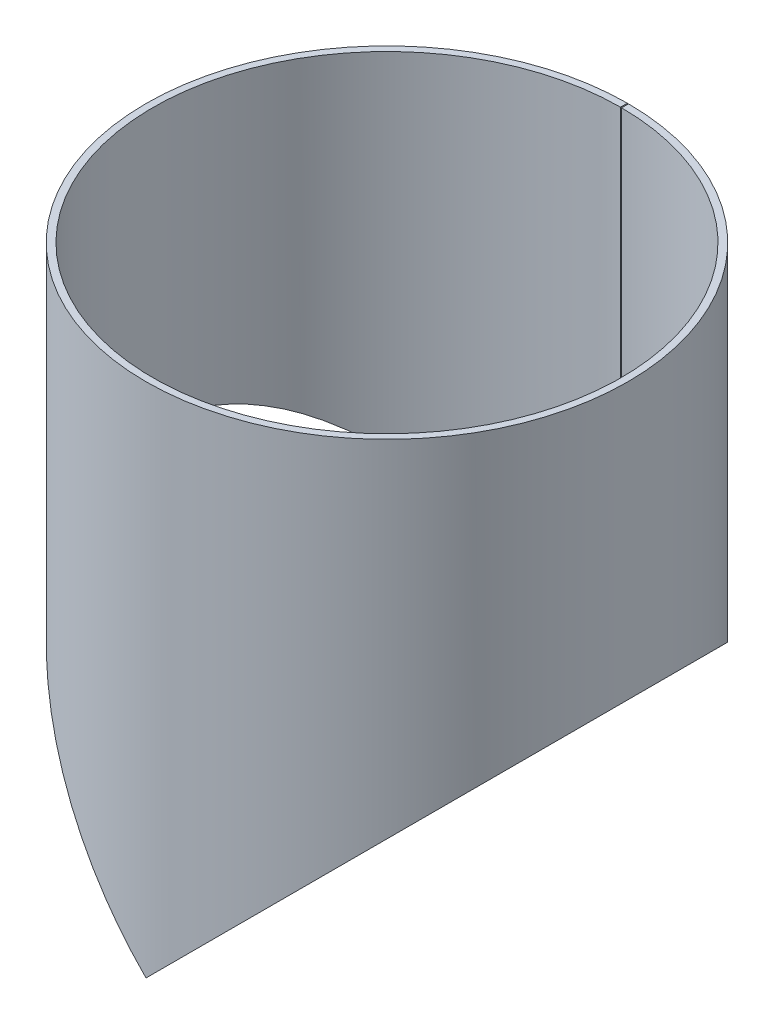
ISO-10303-21;
HEADER;
FILE_DESCRIPTION(('STEP AP214'),'2;1');
FILE_NAME('part.step','',(''),(''),'','','');
FILE_SCHEMA(('AUTOMOTIVE_DESIGN { 1 0 10303 214 1 1 1 1 }'));
ENDSEC;
DATA;
#1=APPLICATION_CONTEXT('core data for automotive mechanical design processes');
#2=APPLICATION_PROTOCOL_DEFINITION('international standard','automotive_design',2000,#1);
#3=PRODUCT_CONTEXT('',#1,'mechanical');
#4=PRODUCT('Part','Part','',(#3));
#5=PRODUCT_RELATED_PRODUCT_CATEGORY('part','',(#4));
#6=PRODUCT_DEFINITION_FORMATION('','',#4);
#7=PRODUCT_DEFINITION_CONTEXT('part definition',#1,'design');
#8=PRODUCT_DEFINITION('design','',#6,#7);
#9=PRODUCT_DEFINITION_SHAPE('','',#8);
#10=(LENGTH_UNIT() NAMED_UNIT(*) SI_UNIT(.MILLI.,.METRE.));
#11=(NAMED_UNIT(*) PLANE_ANGLE_UNIT() SI_UNIT($,.RADIAN.));
#12=(NAMED_UNIT(*) SI_UNIT($,.STERADIAN.) SOLID_ANGLE_UNIT());
#13=UNCERTAINTY_MEASURE_WITH_UNIT(LENGTH_MEASURE(1.E-05),#10,'distance_accuracy_value','');
#14=(GEOMETRIC_REPRESENTATION_CONTEXT(3) GLOBAL_UNCERTAINTY_ASSIGNED_CONTEXT((#13)) GLOBAL_UNIT_ASSIGNED_CONTEXT((#10,
#11,#12)) REPRESENTATION_CONTEXT('',''));
#15=CARTESIAN_POINT('',(0.,0.,0.));
#16=DIRECTION('',(0.,0.,1.));
#17=DIRECTION('',(1.,0.,0.));
#18=AXIS2_PLACEMENT_3D('',#15,#16,#17);
#19=CARTESIAN_POINT('',(1.17906986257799E-13,450.,0.));
#20=DIRECTION('',(0.,-1.,0.));
#21=DIRECTION('',(1.,0.,0.));
#22=AXIS2_PLACEMENT_3D('',#19,#20,#21);
#23=PLANE('',#22);
#24=DIRECTION('',(0.00238095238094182,0.,-0.999997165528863));
#25=VECTOR('',#24,1.);
#26=CARTESIAN_POINT('',(0.48571428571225,450.,-203.999421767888));
#27=LINE('',#26,#25);
#28=CARTESIAN_POINT('',(0.48571428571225,450.,-203.999421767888));
#29=VERTEX_POINT('',#28);
#30=CARTESIAN_POINT('',(0.4999999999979,450.,-209.999404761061));
#31=VERTEX_POINT('',#30);
#32=EDGE_CURVE('E13',#29,#31,#27,.T.);
#33=ORIENTED_EDGE('',*,*,#32,.F.);
#34=CARTESIAN_POINT('',(1.17906986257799E-13,450.,0.));
#35=DIRECTION('',(0.,1.,0.));
#36=DIRECTION('',(-1.,0.,0.));
#37=AXIS2_PLACEMENT_3D('',#34,#35,#36);
#38=CIRCLE('',#37,204.);
#39=CARTESIAN_POINT('',(-0.485714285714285,450.,-203.999421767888));
#40=VERTEX_POINT('',#39);
#41=EDGE_CURVE('E85',#40,#29,#38,.T.);
#42=ORIENTED_EDGE('',*,*,#41,.F.);
#43=DIRECTION('',(-0.00238095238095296,0.,-0.999997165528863));
#44=VECTOR('',#43,1.);
#45=CARTESIAN_POINT('',(-0.485714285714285,450.,-203.999421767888));
#46=LINE('',#45,#44);
#47=CARTESIAN_POINT('',(-0.500000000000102,450.,-209.999404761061));
#48=VERTEX_POINT('',#47);
#49=EDGE_CURVE('E50',#40,#48,#46,.T.);
#50=ORIENTED_EDGE('',*,*,#49,.T.);
#51=CARTESIAN_POINT('',(1.17906986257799E-13,450.,0.));
#52=DIRECTION('',(0.,-1.,0.));
#53=DIRECTION('',(0.,0.,-1.));
#54=AXIS2_PLACEMENT_3D('',#51,#52,#53);
#55=CIRCLE('',#54,210.);
#56=EDGE_CURVE('E87',#48,#31,#55,.F.);
#57=ORIENTED_EDGE('',*,*,#56,.T.);
#58=EDGE_LOOP('',(#33,#42,#50,#57));
#59=FACE_BOUND('',#58,.T.);
#60=ADVANCED_FACE('F38',(#59),#23,.F.);
#61=CARTESIAN_POINT('',(-0.485714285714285,225.25,-203.999421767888));
#62=DIRECTION('',(-0.999997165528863,0.,0.00238095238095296));
#63=DIRECTION('',(0.,1.,0.));
#64=AXIS2_PLACEMENT_3D('',#61,#62,#63);
#65=PLANE('',#64);
#66=ORIENTED_EDGE('',*,*,#49,.F.);
#67=DIRECTION('',(0.,1.,0.));
#68=VECTOR('',#67,1.);
#69=CARTESIAN_POINT('',(-0.485714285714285,0.499999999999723,-203.999421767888));
#70=LINE('',#69,#68);
#71=CARTESIAN_POINT('',(-0.485714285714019,0.499999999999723,-203.999421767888));
#72=VERTEX_POINT('',#71);
#73=EDGE_CURVE('E95',#72,#40,#70,.T.);
#74=ORIENTED_EDGE('',*,*,#73,.F.);
#75=CARTESIAN_POINT('',(-0.499999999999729,0.499999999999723,-209.999404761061));
#76=CARTESIAN_POINT('',(-0.485714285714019,0.499999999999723,-203.999421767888));
#77=B_SPLINE_CURVE_WITH_KNOTS('',1,(#75,#76),.UNSPECIFIED.,.F.,.F.,(2,2),(0.,1.),.UNSPECIFIED.);
#78=CARTESIAN_POINT('',(-0.500000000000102,0.499999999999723,-209.999404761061));
#79=VERTEX_POINT('',#78);
#80=EDGE_CURVE('E225',#72,#79,#77,.F.);
#81=ORIENTED_EDGE('',*,*,#80,.T.);
#82=DIRECTION('',(0.,-1.,0.));
#83=VECTOR('',#82,1.);
#84=CARTESIAN_POINT('',(-0.500000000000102,1807.59112438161,-209.999404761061));
#85=LINE('',#84,#83);
#86=EDGE_CURVE('E156',#79,#48,#85,.F.);
#87=ORIENTED_EDGE('',*,*,#86,.T.);
#88=EDGE_LOOP('',(#66,#74,#81,#87));
#89=FACE_BOUND('',#88,.T.);
#90=ADVANCED_FACE('F191',(#89),#65,.F.);
#91=CARTESIAN_POINT('',(1.72902304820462E-12,0.,210.));
#92=CARTESIAN_POINT('',(-6.40180246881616,6.40178081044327,210.));
#93=CARTESIAN_POINT('',(-11.4889972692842,11.4878403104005,209.719576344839));
#94=CARTESIAN_POINT('',(-15.7316435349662,15.7314050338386,209.41045531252));
#95=CARTESIAN_POINT('',(-16.1825179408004,16.1823719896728,209.376007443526));
#96=CARTESIAN_POINT('',(-17.04324667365,17.0432254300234,209.307702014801));
#97=CARTESIAN_POINT('',(-17.4480542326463,17.4480528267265,209.274278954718));
#98=CARTESIAN_POINT('',(-18.6378277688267,18.6378163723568,209.172811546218));
#99=CARTESIAN_POINT('',(-19.4209599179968,19.4209142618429,209.101481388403));
#100=CARTESIAN_POINT('',(-21.7401463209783,21.7399745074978,208.877425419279));
#101=CARTESIAN_POINT('',(-23.245984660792,23.245703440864,208.714642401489));
#102=CARTESIAN_POINT('',(-27.6423923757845,27.6419565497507,208.19368185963));
#103=CARTESIAN_POINT('',(-30.4117822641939,30.4115470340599,207.803028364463));
#104=CARTESIAN_POINT('',(-34.3240649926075,34.3240653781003,207.180120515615));
#105=CARTESIAN_POINT('',(-35.5812622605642,35.5812707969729,206.96755699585));
#106=CARTESIAN_POINT('',(-38.068670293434,38.0686150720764,206.524507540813));
#107=CARTESIAN_POINT('',(-39.2946371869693,39.2945270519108,206.294565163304));
#108=CARTESIAN_POINT('',(-42.9192145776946,42.9189825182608,205.582113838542));
#109=CARTESIAN_POINT('',(-45.2644786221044,45.2642455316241,205.077005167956));
#110=CARTESIAN_POINT('',(-48.6756947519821,48.6755791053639,204.284212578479));
#111=CARTESIAN_POINT('',(-49.7949927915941,49.7949301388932,204.014087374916));
#112=CARTESIAN_POINT('',(-51.9981077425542,51.9981118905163,203.463721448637));
#113=CARTESIAN_POINT('',(-53.0801413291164,53.0801443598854,203.183984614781));
#114=CARTESIAN_POINT('',(-58.4444104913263,58.4442996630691,201.752271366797));
#115=CARTESIAN_POINT('',(-62.5622090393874,62.5619862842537,200.507502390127));
#116=CARTESIAN_POINT('',(-68.4780958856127,68.4780597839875,198.532295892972));
#117=CARTESIAN_POINT('',(-70.4031156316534,70.4031130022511,197.857215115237));
#118=CARTESIAN_POINT('',(-74.1942164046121,74.1941596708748,196.467031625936));
#119=CARTESIAN_POINT('',(-76.0581902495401,76.0580916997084,195.752508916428));
#120=CARTESIAN_POINT('',(-79.7228732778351,79.7227731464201,194.288848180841));
#121=CARTESIAN_POINT('',(-81.5235829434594,81.5235225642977,193.539710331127));
#122=CARTESIAN_POINT('',(-85.0618130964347,85.0618387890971,192.010942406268));
#123=CARTESIAN_POINT('',(-86.7972131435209,86.7972594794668,191.232322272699));
#124=CARTESIAN_POINT('',(-91.9283539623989,91.928302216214,188.84757584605));
#125=CARTESIAN_POINT('',(-95.2485318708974,95.2483941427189,187.192422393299));
#126=CARTESIAN_POINT('',(-101.687404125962,101.687371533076,183.774202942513));
#127=CARTESIAN_POINT('',(-104.80233248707,104.802313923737,182.013634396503));
#128=CARTESIAN_POINT('',(-110.867997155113,110.867872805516,178.383797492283));
#129=CARTESIAN_POINT('',(-113.815079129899,113.814984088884,176.516207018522));
#130=CARTESIAN_POINT('',(-119.53785406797,119.537870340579,172.692052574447));
#131=CARTESIAN_POINT('',(-122.313723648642,122.313671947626,170.735669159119));
#132=CARTESIAN_POINT('',(-130.422274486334,130.422118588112,164.727936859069));
#133=CARTESIAN_POINT('',(-135.515430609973,135.515397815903,160.553492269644));
#134=CARTESIAN_POINT('',(-145.141608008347,145.141563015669,151.907107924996));
#135=CARTESIAN_POINT('',(-149.66768432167,149.667535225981,147.440936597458));
#136=CARTESIAN_POINT('',(-158.190496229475,158.190278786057,138.257051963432));
#137=CARTESIAN_POINT('',(-162.183722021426,162.183876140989,133.542697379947));
#138=CARTESIAN_POINT('',(-173.401263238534,173.401259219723,119.083368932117));
#139=CARTESIAN_POINT('',(-179.872135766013,179.872139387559,109.01267539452));
#140=CARTESIAN_POINT('',(-190.899175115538,190.899324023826,88.2907331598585));
#141=CARTESIAN_POINT('',(-195.45725071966,195.457254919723,77.6371147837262));
#142=CARTESIAN_POINT('',(-202.738593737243,202.738285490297,55.9296080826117));
#143=CARTESIAN_POINT('',(-205.459226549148,205.459200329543,44.8792641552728));
#144=CARTESIAN_POINT('',(-209.088326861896,209.088357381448,22.5768398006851));
#145=CARTESIAN_POINT('',(-209.995401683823,209.995412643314,11.3272263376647));
#146=CARTESIAN_POINT('',(-210.00227300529,210.002267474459,-5.53525327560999));
#147=CARTESIAN_POINT('',(-209.778774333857,209.778578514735,-11.1610092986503));
#148=CARTESIAN_POINT('',(-208.87931886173,208.879252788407,-22.3859876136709));
#149=CARTESIAN_POINT('',(-208.203867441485,208.203879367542,-27.9832794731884));
#150=CARTESIAN_POINT('',(-205.495445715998,205.495394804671,-44.7132998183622));
#151=CARTESIAN_POINT('',(-202.783390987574,202.783132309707,-55.7671599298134));
#152=CARTESIAN_POINT('',(-195.518756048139,195.518767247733,-77.4822290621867));
#153=CARTESIAN_POINT('',(-190.968787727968,190.968966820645,-88.1402316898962));
#154=CARTESIAN_POINT('',(-179.956777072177,179.95672820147,-108.873030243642));
#155=CARTESIAN_POINT('',(-173.493178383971,173.493133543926,-118.949683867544));
#156=CARTESIAN_POINT('',(-162.284227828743,162.284388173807,-133.420601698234));
#157=CARTESIAN_POINT('',(-158.292651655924,158.292425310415,-138.140196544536));
#158=CARTESIAN_POINT('',(-149.773049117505,149.772907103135,-147.334012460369));
#159=CARTESIAN_POINT('',(-145.247449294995,145.247400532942,-151.806040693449));
#160=CARTESIAN_POINT('',(-138.028818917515,138.028784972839,-158.298828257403));
#161=CARTESIAN_POINT('',(-135.554157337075,135.554175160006,-160.424228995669));
#162=CARTESIAN_POINT('',(-130.453025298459,130.452948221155,-164.599122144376));
#163=CARTESIAN_POINT('',(-127.826371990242,127.826251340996,-166.648566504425));
#164=CARTESIAN_POINT('',(-122.420735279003,122.420690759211,-170.658986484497));
#165=CARTESIAN_POINT('',(-119.644909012,119.644919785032,-172.617940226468));
#166=CARTESIAN_POINT('',(-113.921097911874,113.920995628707,-176.447842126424));
#167=CARTESIAN_POINT('',(-110.973660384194,110.973540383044,-178.318111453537));
#168=CARTESIAN_POINT('',(-104.907654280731,104.907643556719,-181.952978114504));
#169=CARTESIAN_POINT('',(-101.792037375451,101.79199449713,-183.716308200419));
#170=CARTESIAN_POINT('',(-95.3514591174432,95.3513180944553,-187.140054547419));
#171=CARTESIAN_POINT('',(-92.0307022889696,92.0306600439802,-188.797744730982));
#172=CARTESIAN_POINT('',(-86.8991438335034,86.8991931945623,-191.186030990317));
#173=CARTESIAN_POINT('',(-85.1626712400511,85.1626908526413,-191.966244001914));
#174=CARTESIAN_POINT('',(-81.6226838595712,81.6226159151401,-193.497950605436));
#175=CARTESIAN_POINT('',(-79.8211983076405,79.8210938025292,-194.24848456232));
#176=CARTESIAN_POINT('',(-76.1551774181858,76.155080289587,-195.714808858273));
#177=CARTESIAN_POINT('',(-74.2906416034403,74.2905888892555,-196.430599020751));
#178=CARTESIAN_POINT('',(-70.4986386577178,70.4986368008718,-197.823207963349));
#179=CARTESIAN_POINT('',(-68.5720026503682,68.571958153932,-198.499901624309));
#180=CARTESIAN_POINT('',(-62.6513116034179,62.6510877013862,-200.479762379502));
#181=CARTESIAN_POINT('',(-58.5314740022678,58.5313895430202,-201.727059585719));
#182=CARTESIAN_POINT('',(-53.1661967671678,53.1662028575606,-203.161485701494));
#183=CARTESIAN_POINT('',(-52.0827893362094,52.0827848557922,-203.442070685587));
#184=CARTESIAN_POINT('',(-49.876556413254,49.8764770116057,-203.994171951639));
#185=CARTESIAN_POINT('',(-48.7559431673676,48.7558120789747,-204.265081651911));
#186=CARTESIAN_POINT('',(-45.3415218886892,45.3412842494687,-205.060012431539));
#187=CARTESIAN_POINT('',(-42.9951086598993,42.9948883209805,-205.566258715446));
#188=CARTESIAN_POINT('',(-39.3703211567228,39.370228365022,-206.280135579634));
#189=CARTESIAN_POINT('',(-38.1445364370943,38.1444973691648,-206.510506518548));
#190=CARTESIAN_POINT('',(-35.6580015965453,35.658013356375,-206.95434734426));
#191=CARTESIAN_POINT('',(-34.3973477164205,34.3973281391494,-207.167985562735));
#192=CARTESIAN_POINT('',(-30.4763157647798,30.4760479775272,-207.793650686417));
#193=CARTESIAN_POINT('',(-27.7055543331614,27.7051252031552,-208.185242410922));
#194=CARTESIAN_POINT('',(-23.3138882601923,23.3136370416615,-208.70705747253));
#195=CARTESIAN_POINT('',(-21.810763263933,21.8106236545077,-208.870035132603));
#196=CARTESIAN_POINT('',(-19.8829227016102,19.8828769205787,-209.056976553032));
#197=CARTESIAN_POINT('',(-19.4949083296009,19.4948785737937,-209.093525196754));
#198=CARTESIAN_POINT('',(-18.7139917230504,18.7139838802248,-209.16486378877));
#199=CARTESIAN_POINT('',(-18.3247283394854,18.3247342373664,-209.199344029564));
#200=CARTESIAN_POINT('',(-17.1245911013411,17.1245606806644,-209.302157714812));
#201=CARTESIAN_POINT('',(-16.2523509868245,16.2521390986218,-209.372295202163));
#202=CARTESIAN_POINT('',(-11.529679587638,11.5285018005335,-209.717469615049));
#203=CARTESIAN_POINT('',(-6.5931855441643,6.59317888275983,-209.984897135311));
#204=CARTESIAN_POINT('',(-0.499999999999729,0.499999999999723,-209.999404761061));
#205=CARTESIAN_POINT('',(1.68299116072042E-12,0.,204.));
#206=CARTESIAN_POINT('',(-6.2188776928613,6.40176420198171,204.));
#207=CARTESIAN_POINT('',(-11.1607402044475,11.4878403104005,203.727588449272));
#208=CARTESIAN_POINT('',(-15.2821680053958,15.7314050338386,203.427299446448));
#209=CARTESIAN_POINT('',(-15.7201602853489,16.1823719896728,203.393835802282));
#210=CARTESIAN_POINT('',(-16.5562967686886,17.0432254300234,203.327481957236));
#211=CARTESIAN_POINT('',(-16.9495383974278,17.4480528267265,203.295013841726));
#212=CARTESIAN_POINT('',(-18.1053184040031,18.6378163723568,203.19644550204));
#213=CARTESIAN_POINT('',(-18.8660753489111,19.4209142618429,203.127153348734));
#214=CARTESIAN_POINT('',(-21.1189992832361,21.7399745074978,202.909498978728));
#215=CARTESIAN_POINT('',(-22.5818136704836,23.245703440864,202.751366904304));
#216=CARTESIAN_POINT('',(-26.8526097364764,27.6419565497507,202.245290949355));
#217=CARTESIAN_POINT('',(-29.5428741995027,30.4115470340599,201.865798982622));
#218=CARTESIAN_POINT('',(-33.3433774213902,34.3240653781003,201.260688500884));
#219=CARTESIAN_POINT('',(-34.5646547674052,35.5812707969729,201.05419822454));
#220=CARTESIAN_POINT('',(-36.9809939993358,38.0686150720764,200.623807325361));
#221=CARTESIAN_POINT('',(-38.1719332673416,39.2945270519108,200.400434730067));
#222=CARTESIAN_POINT('',(-41.6929513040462,42.9189825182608,199.708339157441));
#223=CARTESIAN_POINT('',(-43.97120780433,45.2642455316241,199.217662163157));
#224=CARTESIAN_POINT('',(-47.2849606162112,48.6755791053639,198.447520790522));
#225=CARTESIAN_POINT('',(-48.3722787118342,49.7949301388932,198.185113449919));
#226=CARTESIAN_POINT('',(-50.5124475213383,51.9981118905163,197.650472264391));
#227=CARTESIAN_POINT('',(-51.5635658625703,53.0801443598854,197.378727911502));
#228=CARTESIAN_POINT('',(-56.7745701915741,58.4442996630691,195.987920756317));
#229=CARTESIAN_POINT('',(-60.7747173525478,62.5619862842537,194.778716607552));
#230=CARTESIAN_POINT('',(-66.5215788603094,68.4780597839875,192.859944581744));
#231=CARTESIAN_POINT('',(-68.3915980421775,70.4031130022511,192.20415182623));
#232=CARTESIAN_POINT('',(-72.0743816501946,74.1941596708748,190.853687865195));
#233=CARTESIAN_POINT('',(-73.8850990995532,76.0580916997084,190.159580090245));
#234=CARTESIAN_POINT('',(-77.4450768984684,79.7227731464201,188.737738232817));
#235=CARTESIAN_POINT('',(-79.1943377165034,81.5235225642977,188.010004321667));
#236=CARTESIAN_POINT('',(-82.6314755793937,85.0618387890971,186.524915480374));
#237=CARTESIAN_POINT('',(-84.3172927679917,86.7972594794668,185.768541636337));
#238=CARTESIAN_POINT('',(-89.3018295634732,91.928302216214,183.451930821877));
#239=CARTESIAN_POINT('',(-92.5271452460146,95.2483941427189,181.844067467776));
#240=CARTESIAN_POINT('',(-98.7820497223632,101.687371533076,178.52351142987));
#241=CARTESIAN_POINT('',(-101.807980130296,104.802313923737,176.813244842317));
#242=CARTESIAN_POINT('',(-107.700340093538,110.867872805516,173.287117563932));
#243=CARTESIAN_POINT('',(-110.563219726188,113.814984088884,171.472886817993));
#244=CARTESIAN_POINT('',(-116.122486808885,119.537870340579,167.757993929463));
#245=CARTESIAN_POINT('',(-118.819045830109,122.313671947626,165.857507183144));
#246=CARTESIAN_POINT('',(-126.695923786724,130.422118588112,160.021424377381));
#247=CARTESIAN_POINT('',(-131.643561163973,135.515397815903,155.966249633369));
#248=CARTESIAN_POINT('',(-140.994704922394,145.141563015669,147.566904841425));
#249=CARTESIAN_POINT('',(-145.391464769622,149.667535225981,143.228338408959));
#250=CARTESIAN_POINT('',(-153.670767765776,158.190278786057,134.306850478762));
#251=CARTESIAN_POINT('',(-157.549901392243,162.183876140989,129.72719174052));
#252=CARTESIAN_POINT('',(-168.446941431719,173.401259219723,115.680986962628));
#253=CARTESIAN_POINT('',(-174.732931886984,179.872139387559,105.898027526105));
#254=CARTESIAN_POINT('',(-185.44491296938,190.899324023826,85.7681407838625));
#255=CARTESIAN_POINT('',(-189.872757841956,195.457254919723,75.4189115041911));
#256=CARTESIAN_POINT('',(-196.946062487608,202.738285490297,54.3316192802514));
#257=CARTESIAN_POINT('',(-199.588962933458,205.459200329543,43.5969994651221));
#258=CARTESIAN_POINT('',(-203.114374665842,209.088357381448,21.9317872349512));
#259=CARTESIAN_POINT('',(-203.995533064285,209.995412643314,11.0035912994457));
#260=CARTESIAN_POINT('',(-204.002208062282,210.002267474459,-5.37710318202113));
#261=CARTESIAN_POINT('',(-203.785095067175,209.778578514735,-10.8421233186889));
#262=CARTESIAN_POINT('',(-202.911338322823,208.879252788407,-21.746387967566));
#263=CARTESIAN_POINT('',(-202.255185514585,208.203879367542,-27.1837572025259));
#264=CARTESIAN_POINT('',(-199.62414726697,205.495394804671,-43.435776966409));
#265=CARTESIAN_POINT('',(-196.9895798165,202.783132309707,-54.1738125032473));
#266=CARTESIAN_POINT('',(-189.932505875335,195.518767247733,-75.2684510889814));
#267=CARTESIAN_POINT('',(-185.512536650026,190.968966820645,-85.6219393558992));
#268=CARTESIAN_POINT('',(-174.815154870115,179.95672820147,-105.762372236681));
#269=CARTESIAN_POINT('',(-168.536230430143,173.493133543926,-115.551121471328));
#270=CARTESIAN_POINT('',(-157.647535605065,162.284388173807,-129.608584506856));
#271=CARTESIAN_POINT('',(-153.770004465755,158.292425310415,-134.19333378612));
#272=CARTESIAN_POINT('',(-145.493819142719,149.772907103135,-143.124469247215));
#273=CARTESIAN_POINT('',(-141.097522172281,145.247400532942,-147.468725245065));
#274=CARTESIAN_POINT('',(-134.085138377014,138.028784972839,-153.776004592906));
#275=CARTESIAN_POINT('',(-131.681181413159,135.554175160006,-155.840679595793));
#276=CARTESIAN_POINT('',(-126.725796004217,130.452948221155,-159.896290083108));
#277=CARTESIAN_POINT('',(-124.174189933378,127.826251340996,-161.887178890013));
#278=CARTESIAN_POINT('',(-118.922999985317,122.420690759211,-165.783015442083));
#279=CARTESIAN_POINT('',(-116.226483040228,119.644919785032,-167.685999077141));
#280=CARTESIAN_POINT('',(-110.666209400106,113.920995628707,-171.406475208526));
#281=CARTESIAN_POINT('',(-107.802984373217,110.973540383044,-173.223308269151));
#282=CARTESIAN_POINT('',(-101.910292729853,104.907643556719,-176.754321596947));
#283=CARTESIAN_POINT('',(-98.8836934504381,101.79199449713,-178.467270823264));
#284=CARTESIAN_POINT('',(-92.6271317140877,95.3513180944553,-181.793195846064));
#285=CARTESIAN_POINT('',(-89.4012536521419,92.0306600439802,-183.403523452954));
#286=CARTESIAN_POINT('',(-84.4163111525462,86.8991931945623,-185.723572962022));
#287=CARTESIAN_POINT('',(-82.7294520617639,85.1626908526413,-186.481494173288));
#288=CARTESIAN_POINT('',(-79.2906071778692,81.6226159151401,-187.969437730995));
#289=CARTESIAN_POINT('',(-77.540592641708,79.8210938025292,-188.69852786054));
#290=CARTESIAN_POINT('',(-73.9793152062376,76.155080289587,-190.122957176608));
#291=CARTESIAN_POINT('',(-72.168051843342,74.2905888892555,-190.818296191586));
#292=CARTESIAN_POINT('',(-68.4843918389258,70.4986368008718,-192.171116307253));
#293=CARTESIAN_POINT('',(-66.6128025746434,68.571958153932,-192.828475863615));
#294=CARTESIAN_POINT('',(-60.8612741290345,62.6510877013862,-194.75176916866));
#295=CARTESIAN_POINT('',(-56.8591461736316,58.5313895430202,-195.963429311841));
#296=CARTESIAN_POINT('',(-51.6471625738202,53.1662028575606,-197.356871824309));
#297=CARTESIAN_POINT('',(-50.5947096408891,52.0827848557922,-197.629440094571));
#298=CARTESIAN_POINT('',(-48.4515119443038,49.8764770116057,-198.165767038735));
#299=CARTESIAN_POINT('',(-47.3629162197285,48.7558120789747,-198.428936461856));
#300=CARTESIAN_POINT('',(-44.0460498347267,45.3412842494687,-199.201154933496));
#301=CARTESIAN_POINT('',(-41.7666769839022,42.9948883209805,-199.692937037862));
#302=CARTESIAN_POINT('',(-38.2454548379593,39.370228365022,-200.386417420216));
#303=CARTESIAN_POINT('',(-37.0546925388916,38.1444973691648,-200.610206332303));
#304=CARTESIAN_POINT('',(-34.6392015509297,35.658013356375,-201.041365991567));
#305=CARTESIAN_POINT('',(-33.4145663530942,34.3973281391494,-201.248900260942));
#306=CARTESIAN_POINT('',(-29.6055638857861,30.4760479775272,-201.856689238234));
#307=CARTESIAN_POINT('',(-26.9139670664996,27.7051252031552,-202.237092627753));
#308=CARTESIAN_POINT('',(-22.6477771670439,23.3136370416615,-202.7439986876));
#309=CARTESIAN_POINT('',(-21.1875985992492,21.8106236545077,-202.9023198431));
#310=CARTESIAN_POINT('',(-19.3148391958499,19.8828769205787,-203.083920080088));
#311=CARTESIAN_POINT('',(-18.9379109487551,19.4948785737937,-203.119424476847));
#312=CARTESIAN_POINT('',(-18.1793062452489,18.7139838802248,-203.188724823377));
#313=CARTESIAN_POINT('',(-17.801164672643,18.3247342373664,-203.222219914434));
#314=CARTESIAN_POINT('',(-16.6353170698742,17.1245606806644,-203.322096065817));
#315=CARTESIAN_POINT('',(-15.7879981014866,16.2521390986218,-203.390229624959));
#316=CARTESIAN_POINT('',(-11.2002601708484,11.5285018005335,-203.725541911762));
#317=CARTESIAN_POINT('',(-6.40479527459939,6.59316494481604,-203.985328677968));
#318=CARTESIAN_POINT('',(-0.485714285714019,0.499999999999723,-203.999421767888));
#319=B_SPLINE_SURFACE_WITH_KNOTS('',1,3,((#91,#92,#93,#94,#95,#96,#97,#98,#99,#100,#101,#102,
#103,#104,#105,#106,#107,#108,#109,#110,#111,#112,#113,#114,#115,#116,#117,#118,#119,#120,#121,
#122,#123,#124,#125,#126,#127,#128,#129,#130,#131,#132,#133,#134,#135,#136,#137,#138,#139,#140,
#141,#142,#143,#144,#145,#146,#147,#148,#149,#150,#151,#152,#153,#154,#155,#156,#157,#158,#159,
#160,#161,#162,#163,#164,#165,#166,#167,#168,#169,#170,#171,#172,#173,#174,#175,#176,#177,#178,
#179,#180,#181,#182,#183,#184,#185,#186,#187,#188,#189,#190,#191,#192,#193,#194,#195,#196,#197,
#198,#199,#200,#201,#202,#203,#204),(#205,#206,#207,#208,#209,#210,#211,#212,#213,#214,#215,
#216,#217,#218,#219,#220,#221,#222,#223,#224,#225,#226,#227,#228,#229,#230,#231,#232,#233,#234,
#235,#236,#237,#238,#239,#240,#241,#242,#243,#244,#245,#246,#247,#248,#249,#250,#251,#252,#253,
#254,#255,#256,#257,#258,#259,#260,#261,#262,#263,#264,#265,#266,#267,#268,#269,#270,#271,#272,
#273,#274,#275,#276,#277,#278,#279,#280,#281,#282,#283,#284,#285,#286,#287,#288,#289,#290,#291,
#292,#293,#294,#295,#296,#297,#298,#299,#300,#301,#302,#303,#304,#305,#306,#307,#308,#309,#310,
#311,#312,#313,#314,#315,#316,#317,#318)),.UNSPECIFIED.,.F.,.F.,.F.,(2,2),(4,2,2,2,2,2,2,2,2,2,
2,2,2,2,2,2,2,2,2,2,2,2,2,2,2,2,2,2,2,2,2,2,2,2,2,2,2,2,2,2,2,2,2,2,2,2,2,2,2,2,2,2,2,2,2,2,4),
(0.,1.),(0.,0.0078125,0.0087890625,0.009765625,0.01171875,0.015625,0.0234375,0.02734375,0.03125,
0.0390625,0.04296875,0.046875,0.0625,0.0703125,0.078125,0.0859375,0.09375,0.109375,0.125,
0.140625,0.15625,0.1875,0.21875,0.25,0.3125,0.375,0.4375,0.5,0.53125,0.5625,0.625,0.6875,0.75,
0.78125,0.8125,0.828125,0.84375,0.859375,0.875,0.890625,0.90625,0.9140625,0.921875,0.9296875,
0.9375,0.953125,0.95703125,0.9609375,0.96875,0.97265625,0.9765625,0.984375,0.98828125,
0.9892578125,0.990234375,0.9921875,1.),.UNSPECIFIED.);
#320=CARTESIAN_POINT('',(-0.485714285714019,0.499999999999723,-203.999421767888));
#321=CARTESIAN_POINT('',(-6.40479527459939,6.59316494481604,-203.985328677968));
#322=CARTESIAN_POINT('',(-11.2002601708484,11.5285018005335,-203.725541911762));
#323=CARTESIAN_POINT('',(-15.7879981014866,16.2521390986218,-203.390229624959));
#324=CARTESIAN_POINT('',(-16.6353170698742,17.1245606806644,-203.322096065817));
#325=CARTESIAN_POINT('',(-17.801164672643,18.3247342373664,-203.222219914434));
#326=CARTESIAN_POINT('',(-18.1793062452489,18.7139838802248,-203.188724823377));
#327=CARTESIAN_POINT('',(-18.9379109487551,19.4948785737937,-203.119424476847));
#328=CARTESIAN_POINT('',(-19.3148391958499,19.8828769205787,-203.083920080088));
#329=CARTESIAN_POINT('',(-21.1875985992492,21.8106236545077,-202.9023198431));
#330=CARTESIAN_POINT('',(-22.6477771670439,23.3136370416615,-202.7439986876));
#331=CARTESIAN_POINT('',(-26.9139670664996,27.7051252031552,-202.237092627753));
#332=CARTESIAN_POINT('',(-29.6055638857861,30.4760479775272,-201.856689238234));
#333=CARTESIAN_POINT('',(-33.4145663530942,34.3973281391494,-201.248900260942));
#334=CARTESIAN_POINT('',(-34.6392015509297,35.658013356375,-201.041365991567));
#335=CARTESIAN_POINT('',(-37.0546925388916,38.1444973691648,-200.610206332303));
#336=CARTESIAN_POINT('',(-38.2454548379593,39.370228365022,-200.386417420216));
#337=CARTESIAN_POINT('',(-41.7666769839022,42.9948883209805,-199.692937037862));
#338=CARTESIAN_POINT('',(-44.0460498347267,45.3412842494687,-199.201154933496));
#339=CARTESIAN_POINT('',(-47.3629162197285,48.7558120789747,-198.428936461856));
#340=CARTESIAN_POINT('',(-48.4515119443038,49.8764770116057,-198.165767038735));
#341=CARTESIAN_POINT('',(-50.5947096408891,52.0827848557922,-197.629440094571));
#342=CARTESIAN_POINT('',(-51.6471625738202,53.1662028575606,-197.356871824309));
#343=CARTESIAN_POINT('',(-56.8591461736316,58.5313895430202,-195.963429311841));
#344=CARTESIAN_POINT('',(-60.8612741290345,62.6510877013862,-194.75176916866));
#345=CARTESIAN_POINT('',(-66.6128025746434,68.571958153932,-192.828475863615));
#346=CARTESIAN_POINT('',(-68.4843918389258,70.4986368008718,-192.171116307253));
#347=CARTESIAN_POINT('',(-72.168051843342,74.2905888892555,-190.818296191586));
#348=CARTESIAN_POINT('',(-73.9793152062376,76.155080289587,-190.122957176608));
#349=CARTESIAN_POINT('',(-77.540592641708,79.8210938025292,-188.69852786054));
#350=CARTESIAN_POINT('',(-79.2906071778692,81.6226159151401,-187.969437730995));
#351=CARTESIAN_POINT('',(-82.7294520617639,85.1626908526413,-186.481494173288));
#352=CARTESIAN_POINT('',(-84.4163111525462,86.8991931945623,-185.723572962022));
#353=CARTESIAN_POINT('',(-89.4012536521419,92.0306600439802,-183.403523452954));
#354=CARTESIAN_POINT('',(-92.6271317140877,95.3513180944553,-181.793195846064));
#355=CARTESIAN_POINT('',(-98.8836934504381,101.79199449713,-178.467270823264));
#356=CARTESIAN_POINT('',(-101.910292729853,104.907643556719,-176.754321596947));
#357=CARTESIAN_POINT('',(-107.802984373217,110.973540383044,-173.223308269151));
#358=CARTESIAN_POINT('',(-110.666209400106,113.920995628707,-171.406475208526));
#359=CARTESIAN_POINT('',(-116.226483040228,119.644919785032,-167.685999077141));
#360=CARTESIAN_POINT('',(-118.922999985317,122.420690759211,-165.783015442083));
#361=CARTESIAN_POINT('',(-124.174189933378,127.826251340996,-161.887178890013));
#362=CARTESIAN_POINT('',(-126.725796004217,130.452948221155,-159.896290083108));
#363=CARTESIAN_POINT('',(-131.681181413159,135.554175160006,-155.840679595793));
#364=CARTESIAN_POINT('',(-134.085138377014,138.028784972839,-153.776004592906));
#365=CARTESIAN_POINT('',(-141.097522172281,145.247400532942,-147.468725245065));
#366=CARTESIAN_POINT('',(-145.493819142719,149.772907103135,-143.124469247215));
#367=CARTESIAN_POINT('',(-153.770004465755,158.292425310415,-134.19333378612));
#368=CARTESIAN_POINT('',(-157.647535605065,162.284388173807,-129.608584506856));
#369=CARTESIAN_POINT('',(-168.536230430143,173.493133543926,-115.551121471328));
#370=CARTESIAN_POINT('',(-174.815154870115,179.95672820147,-105.762372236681));
#371=CARTESIAN_POINT('',(-185.512536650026,190.968966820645,-85.6219393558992));
#372=CARTESIAN_POINT('',(-189.932505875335,195.518767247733,-75.2684510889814));
#373=CARTESIAN_POINT('',(-196.9895798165,202.783132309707,-54.1738125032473));
#374=CARTESIAN_POINT('',(-199.62414726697,205.495394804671,-43.435776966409));
#375=CARTESIAN_POINT('',(-202.255185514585,208.203879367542,-27.1837572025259));
#376=CARTESIAN_POINT('',(-202.911338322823,208.879252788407,-21.746387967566));
#377=CARTESIAN_POINT('',(-203.785095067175,209.778578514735,-10.8421233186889));
#378=CARTESIAN_POINT('',(-204.002208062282,210.002267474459,-5.37710318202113));
#379=CARTESIAN_POINT('',(-203.995533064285,209.995412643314,11.0035912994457));
#380=CARTESIAN_POINT('',(-203.114374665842,209.088357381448,21.9317872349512));
#381=CARTESIAN_POINT('',(-199.588962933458,205.459200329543,43.5969994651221));
#382=CARTESIAN_POINT('',(-196.946062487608,202.738285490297,54.3316192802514));
#383=CARTESIAN_POINT('',(-189.872757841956,195.457254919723,75.4189115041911));
#384=CARTESIAN_POINT('',(-185.44491296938,190.899324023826,85.7681407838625));
#385=CARTESIAN_POINT('',(-174.732931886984,179.872139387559,105.898027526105));
#386=CARTESIAN_POINT('',(-168.446941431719,173.401259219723,115.680986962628));
#387=CARTESIAN_POINT('',(-157.549901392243,162.183876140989,129.72719174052));
#388=CARTESIAN_POINT('',(-153.670767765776,158.190278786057,134.306850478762));
#389=CARTESIAN_POINT('',(-145.391464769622,149.667535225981,143.228338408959));
#390=CARTESIAN_POINT('',(-140.994704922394,145.141563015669,147.566904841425));
#391=CARTESIAN_POINT('',(-131.643561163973,135.515397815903,155.966249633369));
#392=CARTESIAN_POINT('',(-126.695923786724,130.422118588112,160.021424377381));
#393=CARTESIAN_POINT('',(-118.819045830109,122.313671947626,165.857507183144));
#394=CARTESIAN_POINT('',(-116.122486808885,119.537870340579,167.757993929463));
#395=CARTESIAN_POINT('',(-110.563219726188,113.814984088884,171.472886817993));
#396=CARTESIAN_POINT('',(-107.700340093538,110.867872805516,173.287117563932));
#397=CARTESIAN_POINT('',(-101.807980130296,104.802313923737,176.813244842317));
#398=CARTESIAN_POINT('',(-98.7820497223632,101.687371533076,178.52351142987));
#399=CARTESIAN_POINT('',(-92.5271452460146,95.2483941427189,181.844067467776));
#400=CARTESIAN_POINT('',(-89.3018295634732,91.928302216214,183.451930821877));
#401=CARTESIAN_POINT('',(-84.3172927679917,86.7972594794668,185.768541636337));
#402=CARTESIAN_POINT('',(-82.6314755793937,85.0618387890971,186.524915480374));
#403=CARTESIAN_POINT('',(-79.1943377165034,81.5235225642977,188.010004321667));
#404=CARTESIAN_POINT('',(-77.4450768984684,79.7227731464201,188.737738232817));
#405=CARTESIAN_POINT('',(-73.8850990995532,76.0580916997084,190.159580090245));
#406=CARTESIAN_POINT('',(-72.0743816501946,74.1941596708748,190.853687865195));
#407=CARTESIAN_POINT('',(-68.3915980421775,70.4031130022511,192.20415182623));
#408=CARTESIAN_POINT('',(-66.5215788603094,68.4780597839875,192.859944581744));
#409=CARTESIAN_POINT('',(-60.7747173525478,62.5619862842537,194.778716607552));
#410=CARTESIAN_POINT('',(-56.7745701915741,58.4442996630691,195.987920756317));
#411=CARTESIAN_POINT('',(-51.5635658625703,53.0801443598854,197.378727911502));
#412=CARTESIAN_POINT('',(-50.5124475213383,51.9981118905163,197.650472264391));
#413=CARTESIAN_POINT('',(-48.3722787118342,49.7949301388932,198.185113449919));
#414=CARTESIAN_POINT('',(-47.2849606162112,48.6755791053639,198.447520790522));
#415=CARTESIAN_POINT('',(-43.97120780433,45.2642455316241,199.217662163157));
#416=CARTESIAN_POINT('',(-41.6929513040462,42.9189825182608,199.708339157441));
#417=CARTESIAN_POINT('',(-38.1719332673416,39.2945270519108,200.400434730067));
#418=CARTESIAN_POINT('',(-36.9809939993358,38.0686150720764,200.623807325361));
#419=CARTESIAN_POINT('',(-34.5646547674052,35.5812707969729,201.05419822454));
#420=CARTESIAN_POINT('',(-33.3433774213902,34.3240653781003,201.260688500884));
#421=CARTESIAN_POINT('',(-29.5428741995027,30.4115470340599,201.865798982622));
#422=CARTESIAN_POINT('',(-26.8526097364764,27.6419565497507,202.245290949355));
#423=CARTESIAN_POINT('',(-22.5818136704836,23.245703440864,202.751366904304));
#424=CARTESIAN_POINT('',(-21.1189992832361,21.7399745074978,202.909498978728));
#425=CARTESIAN_POINT('',(-18.8660753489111,19.4209142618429,203.127153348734));
#426=CARTESIAN_POINT('',(-18.1053184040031,18.6378163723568,203.19644550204));
#427=CARTESIAN_POINT('',(-16.9495383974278,17.4480528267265,203.295013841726));
#428=CARTESIAN_POINT('',(-16.5562967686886,17.0432254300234,203.327481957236));
#429=CARTESIAN_POINT('',(-15.7201602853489,16.1823719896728,203.393835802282));
#430=CARTESIAN_POINT('',(-15.2821680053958,15.7314050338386,203.427299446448));
#431=CARTESIAN_POINT('',(-11.1607402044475,11.4878403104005,203.727588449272));
#432=CARTESIAN_POINT('',(-6.2188776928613,6.40176420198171,204.));
#433=CARTESIAN_POINT('',(1.68299116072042E-12,0.,204.));
#434=B_SPLINE_CURVE_WITH_KNOTS('',3,(#320,#321,#322,#323,#324,#325,#326,#327,#328,#329,#330,
#331,#332,#333,#334,#335,#336,#337,#338,#339,#340,#341,#342,#343,#344,#345,#346,#347,#348,#349,
#350,#351,#352,#353,#354,#355,#356,#357,#358,#359,#360,#361,#362,#363,#364,#365,#366,#367,#368,
#369,#370,#371,#372,#373,#374,#375,#376,#377,#378,#379,#380,#381,#382,#383,#384,#385,#386,#387,
#388,#389,#390,#391,#392,#393,#394,#395,#396,#397,#398,#399,#400,#401,#402,#403,#404,#405,#406,
#407,#408,#409,#410,#411,#412,#413,#414,#415,#416,#417,#418,#419,#420,#421,#422,#423,#424,#425,
#426,#427,#428,#429,#430,#431,#432,#433),.UNSPECIFIED.,.F.,.F.,(4,2,2,2,2,2,2,2,2,2,2,2,2,2,2,2,
2,2,2,2,2,2,2,2,2,2,2,2,2,2,2,2,2,2,2,2,2,2,2,2,2,2,2,2,2,2,2,2,2,2,2,2,2,2,2,2,4),(0.,
0.0078125,0.009765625,0.0107421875,0.01171875,0.015625,0.0234375,0.02734375,0.03125,0.0390625,
0.04296875,0.046875,0.0625,0.0703125,0.078125,0.0859375,0.09375,0.109375,0.125,0.140625,0.15625,
0.171875,0.1875,0.21875,0.25,0.3125,0.375,0.4375,0.46875,0.5,0.5625,0.625,0.6875,0.75,0.78125,
0.8125,0.84375,0.859375,0.875,0.890625,0.90625,0.9140625,0.921875,0.9296875,0.9375,0.953125,
0.95703125,0.9609375,0.96875,0.97265625,0.9765625,0.984375,0.98828125,0.990234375,0.9912109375,
0.9921875,1.),.UNSPECIFIED.);
#435=CARTESIAN_POINT('',(1.68299116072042E-12,0.,204.));
#436=VERTEX_POINT('',#435);
#437=EDGE_CURVE('E169',#436,#72,#434,.F.);
#438=CARTESIAN_POINT('',(1.68299116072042E-12,0.,204.));
#439=CARTESIAN_POINT('',(1.72902304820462E-12,0.,210.));
#440=B_SPLINE_CURVE_WITH_KNOTS('',1,(#438,#439),.UNSPECIFIED.,.F.,.F.,(2,2),(0.,1.),.UNSPECIFIED.);
#441=CARTESIAN_POINT('',(-2.5545184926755E-07,2.55452548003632E-07,210.));
#442=VERTEX_POINT('',#441);
#443=EDGE_CURVE('E155',#436,#442,#440,.T.);
#444=CARTESIAN_POINT('',(1.72902304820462E-12,0.,210.));
#445=CARTESIAN_POINT('',(-6.40180246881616,6.40178081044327,210.));
#446=CARTESIAN_POINT('',(-11.4889972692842,11.4878403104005,209.719576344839));
#447=CARTESIAN_POINT('',(-15.7316435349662,15.7314050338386,209.41045531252));
#448=CARTESIAN_POINT('',(-16.1825179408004,16.1823719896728,209.376007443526));
#449=CARTESIAN_POINT('',(-17.04324667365,17.0432254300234,209.307702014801));
#450=CARTESIAN_POINT('',(-17.4480542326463,17.4480528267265,209.274278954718));
#451=CARTESIAN_POINT('',(-18.6378277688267,18.6378163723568,209.172811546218));
#452=CARTESIAN_POINT('',(-19.4209599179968,19.4209142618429,209.101481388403));
#453=CARTESIAN_POINT('',(-21.7401463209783,21.7399745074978,208.877425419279));
#454=CARTESIAN_POINT('',(-23.245984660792,23.245703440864,208.714642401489));
#455=CARTESIAN_POINT('',(-27.6423923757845,27.6419565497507,208.19368185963));
#456=CARTESIAN_POINT('',(-30.4117822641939,30.4115470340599,207.803028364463));
#457=CARTESIAN_POINT('',(-34.3240649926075,34.3240653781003,207.180120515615));
#458=CARTESIAN_POINT('',(-35.5812622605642,35.5812707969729,206.96755699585));
#459=CARTESIAN_POINT('',(-38.068670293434,38.0686150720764,206.524507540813));
#460=CARTESIAN_POINT('',(-39.2946371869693,39.2945270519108,206.294565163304));
#461=CARTESIAN_POINT('',(-42.9192145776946,42.9189825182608,205.582113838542));
#462=CARTESIAN_POINT('',(-45.2644786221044,45.2642455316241,205.077005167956));
#463=CARTESIAN_POINT('',(-48.6756947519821,48.6755791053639,204.284212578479));
#464=CARTESIAN_POINT('',(-49.7949927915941,49.7949301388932,204.014087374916));
#465=CARTESIAN_POINT('',(-51.9981077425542,51.9981118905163,203.463721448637));
#466=CARTESIAN_POINT('',(-53.0801413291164,53.0801443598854,203.183984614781));
#467=CARTESIAN_POINT('',(-58.4444104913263,58.4442996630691,201.752271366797));
#468=CARTESIAN_POINT('',(-62.5622090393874,62.5619862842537,200.507502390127));
#469=CARTESIAN_POINT('',(-68.4780958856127,68.4780597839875,198.532295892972));
#470=CARTESIAN_POINT('',(-70.4031156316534,70.4031130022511,197.857215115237));
#471=CARTESIAN_POINT('',(-74.1942164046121,74.1941596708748,196.467031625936));
#472=CARTESIAN_POINT('',(-76.0581902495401,76.0580916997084,195.752508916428));
#473=CARTESIAN_POINT('',(-79.7228732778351,79.7227731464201,194.288848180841));
#474=CARTESIAN_POINT('',(-81.5235829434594,81.5235225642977,193.539710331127));
#475=CARTESIAN_POINT('',(-85.0618130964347,85.0618387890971,192.010942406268));
#476=CARTESIAN_POINT('',(-86.7972131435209,86.7972594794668,191.232322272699));
#477=CARTESIAN_POINT('',(-91.9283539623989,91.928302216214,188.84757584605));
#478=CARTESIAN_POINT('',(-95.2485318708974,95.2483941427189,187.192422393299));
#479=CARTESIAN_POINT('',(-101.687404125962,101.687371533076,183.774202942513));
#480=CARTESIAN_POINT('',(-104.80233248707,104.802313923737,182.013634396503));
#481=CARTESIAN_POINT('',(-110.867997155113,110.867872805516,178.383797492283));
#482=CARTESIAN_POINT('',(-113.815079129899,113.814984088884,176.516207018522));
#483=CARTESIAN_POINT('',(-119.53785406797,119.537870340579,172.692052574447));
#484=CARTESIAN_POINT('',(-122.313723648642,122.313671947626,170.735669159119));
#485=CARTESIAN_POINT('',(-130.422274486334,130.422118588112,164.727936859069));
#486=CARTESIAN_POINT('',(-135.515430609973,135.515397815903,160.553492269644));
#487=CARTESIAN_POINT('',(-145.141608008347,145.141563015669,151.907107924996));
#488=CARTESIAN_POINT('',(-149.66768432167,149.667535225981,147.440936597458));
#489=CARTESIAN_POINT('',(-158.190496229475,158.190278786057,138.257051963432));
#490=CARTESIAN_POINT('',(-162.183722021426,162.183876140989,133.542697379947));
#491=CARTESIAN_POINT('',(-173.401263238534,173.401259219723,119.083368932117));
#492=CARTESIAN_POINT('',(-179.872135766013,179.872139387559,109.01267539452));
#493=CARTESIAN_POINT('',(-190.899175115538,190.899324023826,88.2907331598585));
#494=CARTESIAN_POINT('',(-195.45725071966,195.457254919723,77.6371147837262));
#495=CARTESIAN_POINT('',(-202.738593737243,202.738285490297,55.9296080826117));
#496=CARTESIAN_POINT('',(-205.459226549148,205.459200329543,44.8792641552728));
#497=CARTESIAN_POINT('',(-209.088326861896,209.088357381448,22.5768398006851));
#498=CARTESIAN_POINT('',(-209.995401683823,209.995412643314,11.3272263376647));
#499=CARTESIAN_POINT('',(-210.00227300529,210.002267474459,-5.53525327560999));
#500=CARTESIAN_POINT('',(-209.778774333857,209.778578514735,-11.1610092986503));
#501=CARTESIAN_POINT('',(-208.87931886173,208.879252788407,-22.3859876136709));
#502=CARTESIAN_POINT('',(-208.203867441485,208.203879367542,-27.9832794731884));
#503=CARTESIAN_POINT('',(-205.495445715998,205.495394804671,-44.7132998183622));
#504=CARTESIAN_POINT('',(-202.783390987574,202.783132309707,-55.7671599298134));
#505=CARTESIAN_POINT('',(-195.518756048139,195.518767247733,-77.4822290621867));
#506=CARTESIAN_POINT('',(-190.968787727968,190.968966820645,-88.1402316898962));
#507=CARTESIAN_POINT('',(-179.956777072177,179.95672820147,-108.873030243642));
#508=CARTESIAN_POINT('',(-173.493178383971,173.493133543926,-118.949683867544));
#509=CARTESIAN_POINT('',(-162.284227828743,162.284388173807,-133.420601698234));
#510=CARTESIAN_POINT('',(-158.292651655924,158.292425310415,-138.140196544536));
#511=CARTESIAN_POINT('',(-149.773049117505,149.772907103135,-147.334012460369));
#512=CARTESIAN_POINT('',(-145.247449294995,145.247400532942,-151.806040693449));
#513=CARTESIAN_POINT('',(-138.028818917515,138.028784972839,-158.298828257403));
#514=CARTESIAN_POINT('',(-135.554157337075,135.554175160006,-160.424228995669));
#515=CARTESIAN_POINT('',(-130.453025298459,130.452948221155,-164.599122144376));
#516=CARTESIAN_POINT('',(-127.826371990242,127.826251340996,-166.648566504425));
#517=CARTESIAN_POINT('',(-122.420735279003,122.420690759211,-170.658986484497));
#518=CARTESIAN_POINT('',(-119.644909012,119.644919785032,-172.617940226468));
#519=CARTESIAN_POINT('',(-113.921097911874,113.920995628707,-176.447842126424));
#520=CARTESIAN_POINT('',(-110.973660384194,110.973540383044,-178.318111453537));
#521=CARTESIAN_POINT('',(-104.907654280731,104.907643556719,-181.952978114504));
#522=CARTESIAN_POINT('',(-101.792037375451,101.79199449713,-183.716308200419));
#523=CARTESIAN_POINT('',(-95.3514591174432,95.3513180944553,-187.140054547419));
#524=CARTESIAN_POINT('',(-92.0307022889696,92.0306600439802,-188.797744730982));
#525=CARTESIAN_POINT('',(-86.8991438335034,86.8991931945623,-191.186030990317));
#526=CARTESIAN_POINT('',(-85.1626712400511,85.1626908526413,-191.966244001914));
#527=CARTESIAN_POINT('',(-81.6226838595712,81.6226159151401,-193.497950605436));
#528=CARTESIAN_POINT('',(-79.8211983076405,79.8210938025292,-194.24848456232));
#529=CARTESIAN_POINT('',(-76.1551774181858,76.155080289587,-195.714808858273));
#530=CARTESIAN_POINT('',(-74.2906416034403,74.2905888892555,-196.430599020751));
#531=CARTESIAN_POINT('',(-70.4986386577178,70.4986368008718,-197.823207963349));
#532=CARTESIAN_POINT('',(-68.5720026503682,68.571958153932,-198.499901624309));
#533=CARTESIAN_POINT('',(-62.6513116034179,62.6510877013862,-200.479762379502));
#534=CARTESIAN_POINT('',(-58.5314740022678,58.5313895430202,-201.727059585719));
#535=CARTESIAN_POINT('',(-53.1661967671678,53.1662028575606,-203.161485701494));
#536=CARTESIAN_POINT('',(-52.0827893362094,52.0827848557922,-203.442070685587));
#537=CARTESIAN_POINT('',(-49.876556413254,49.8764770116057,-203.994171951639));
#538=CARTESIAN_POINT('',(-48.7559431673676,48.7558120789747,-204.265081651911));
#539=CARTESIAN_POINT('',(-45.3415218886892,45.3412842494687,-205.060012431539));
#540=CARTESIAN_POINT('',(-42.9951086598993,42.9948883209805,-205.566258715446));
#541=CARTESIAN_POINT('',(-39.3703211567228,39.370228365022,-206.280135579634));
#542=CARTESIAN_POINT('',(-38.1445364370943,38.1444973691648,-206.510506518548));
#543=CARTESIAN_POINT('',(-35.6580015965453,35.658013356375,-206.95434734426));
#544=CARTESIAN_POINT('',(-34.3973477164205,34.3973281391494,-207.167985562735));
#545=CARTESIAN_POINT('',(-30.4763157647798,30.4760479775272,-207.793650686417));
#546=CARTESIAN_POINT('',(-27.7055543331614,27.7051252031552,-208.185242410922));
#547=CARTESIAN_POINT('',(-23.3138882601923,23.3136370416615,-208.70705747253));
#548=CARTESIAN_POINT('',(-21.810763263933,21.8106236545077,-208.870035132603));
#549=CARTESIAN_POINT('',(-19.8829227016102,19.8828769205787,-209.056976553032));
#550=CARTESIAN_POINT('',(-19.4949083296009,19.4948785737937,-209.093525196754));
#551=CARTESIAN_POINT('',(-18.7139917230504,18.7139838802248,-209.16486378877));
#552=CARTESIAN_POINT('',(-18.3247283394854,18.3247342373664,-209.199344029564));
#553=CARTESIAN_POINT('',(-17.1245911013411,17.1245606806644,-209.302157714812));
#554=CARTESIAN_POINT('',(-16.2523509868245,16.2521390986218,-209.372295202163));
#555=CARTESIAN_POINT('',(-11.529679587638,11.5285018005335,-209.717469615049));
#556=CARTESIAN_POINT('',(-6.5931855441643,6.59317888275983,-209.984897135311));
#557=CARTESIAN_POINT('',(-0.499999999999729,0.499999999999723,-209.999404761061));
#558=B_SPLINE_CURVE_WITH_KNOTS('',3,(#444,#445,#446,#447,#448,#449,#450,#451,#452,#453,#454,
#455,#456,#457,#458,#459,#460,#461,#462,#463,#464,#465,#466,#467,#468,#469,#470,#471,#472,#473,
#474,#475,#476,#477,#478,#479,#480,#481,#482,#483,#484,#485,#486,#487,#488,#489,#490,#491,#492,
#493,#494,#495,#496,#497,#498,#499,#500,#501,#502,#503,#504,#505,#506,#507,#508,#509,#510,#511,
#512,#513,#514,#515,#516,#517,#518,#519,#520,#521,#522,#523,#524,#525,#526,#527,#528,#529,#530,
#531,#532,#533,#534,#535,#536,#537,#538,#539,#540,#541,#542,#543,#544,#545,#546,#547,#548,#549,
#550,#551,#552,#553,#554,#555,#556,#557),.UNSPECIFIED.,.F.,.F.,(4,2,2,2,2,2,2,2,2,2,2,2,2,2,2,2,
2,2,2,2,2,2,2,2,2,2,2,2,2,2,2,2,2,2,2,2,2,2,2,2,2,2,2,2,2,2,2,2,2,2,2,2,2,2,2,2,4),(0.,
0.0078125,0.0087890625,0.009765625,0.01171875,0.015625,0.0234375,0.02734375,0.03125,0.0390625,
0.04296875,0.046875,0.0625,0.0703125,0.078125,0.0859375,0.09375,0.109375,0.125,0.140625,0.15625,
0.1875,0.21875,0.25,0.3125,0.375,0.4375,0.5,0.53125,0.5625,0.625,0.6875,0.75,0.78125,0.8125,
0.828125,0.84375,0.859375,0.875,0.890625,0.90625,0.9140625,0.921875,0.9296875,0.9375,0.953125,
0.95703125,0.9609375,0.96875,0.97265625,0.9765625,0.984375,0.98828125,0.9892578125,0.990234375,
0.9921875,1.),.UNSPECIFIED.);
#559=EDGE_CURVE('E102',#442,#79,#558,.T.);
#560=ORIENTED_EDGE('',*,*,#80,.F.);
#561=ORIENTED_EDGE('',*,*,#437,.F.);
#562=ORIENTED_EDGE('',*,*,#443,.T.);
#563=ORIENTED_EDGE('',*,*,#559,.T.);
#564=EDGE_LOOP('',(#560,#561,#562,#563));
#565=FACE_BOUND('',#564,.T.);
#566=ADVANCED_FACE('F180',(#565),#319,.F.);
#567=CARTESIAN_POINT('',(0.499999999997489,0.499999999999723,-209.999404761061));
#568=CARTESIAN_POINT('',(6.58654397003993,6.58653708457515,-209.984912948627));
#569=CARTESIAN_POINT('',(11.5189131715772,11.5177329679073,-209.718031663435));
#570=CARTESIAN_POINT('',(16.2395628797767,16.2393483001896,-209.373285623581));
#571=CARTESIAN_POINT('',(17.1115550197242,17.1115224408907,-209.30322351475));
#572=CARTESIAN_POINT('',(18.3115538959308,18.3115602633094,-209.200497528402));
#573=CARTESIAN_POINT('',(18.7002652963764,18.7002577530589,-209.166090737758));
#574=CARTESIAN_POINT('',(19.4804413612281,19.4804121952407,-209.094872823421));
#575=CARTESIAN_POINT('',(19.8680912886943,19.8680462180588,-209.058385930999));
#576=CARTESIAN_POINT('',(21.7941387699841,21.7940003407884,-208.871759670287));
#577=CARTESIAN_POINT('',(23.2959225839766,23.2956724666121,-208.709054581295));
#578=CARTESIAN_POINT('',(27.6838446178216,27.6834153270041,-208.188094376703));
#579=CARTESIAN_POINT('',(30.4524829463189,30.4522125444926,-207.79712146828));
#580=CARTESIAN_POINT('',(34.3708826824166,34.3708613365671,-207.172372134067));
#581=CARTESIAN_POINT('',(35.6307696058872,35.6307814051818,-206.95903091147));
#582=CARTESIAN_POINT('',(38.1152251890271,38.1151875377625,-206.51591180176));
#583=CARTESIAN_POINT('',(39.3400119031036,39.3399207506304,-206.285912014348));
#584=CARTESIAN_POINT('',(42.9619298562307,42.9617108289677,-205.57317118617));
#585=CARTESIAN_POINT('',(45.3065960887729,45.30635813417,-205.067712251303));
#586=CARTESIAN_POINT('',(48.7186426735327,48.7185099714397,-204.27397636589));
#587=CARTESIAN_POINT('',(49.8385053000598,49.8384240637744,-204.003467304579));
#588=CARTESIAN_POINT('',(52.0433181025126,52.0433125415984,-203.452167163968));
#589=CARTESIAN_POINT('',(53.1260436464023,53.1260501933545,-203.171984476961));
#590=CARTESIAN_POINT('',(58.4873437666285,58.4872615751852,-201.73978104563));
#591=CARTESIAN_POINT('',(62.6046446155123,62.6044113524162,-200.494291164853));
#592=CARTESIAN_POINT('',(68.5224586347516,68.5224070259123,-198.516997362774));
#593=CARTESIAN_POINT('',(70.4482836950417,70.4482828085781,-197.841134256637));
#594=CARTESIAN_POINT('',(74.238518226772,74.2384730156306,-196.450292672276));
#595=CARTESIAN_POINT('',(76.1022824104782,76.1021919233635,-195.735373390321));
#596=CARTESIAN_POINT('',(81.5993279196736,81.5992200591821,-193.538432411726));
#597=CARTESIAN_POINT('',(85.1330752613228,85.1331528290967,-192.006737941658));
#598=CARTESIAN_POINT('',(91.9735332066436,91.9734969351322,-188.825573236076));
#599=CARTESIAN_POINT('',(95.2936575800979,95.2935185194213,-187.169472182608));
#600=CARTESIAN_POINT('',(101.733305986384,101.733260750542,-183.748814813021));
#601=CARTESIAN_POINT('',(104.848577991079,104.848569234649,-181.987004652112));
#602=CARTESIAN_POINT('',(110.913841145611,110.913722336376,-178.355302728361));
#603=CARTESIAN_POINT('',(113.86101544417,113.860911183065,-176.486599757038));
#604=CARTESIAN_POINT('',(119.584504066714,119.584513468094,-172.659772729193));
#605=CARTESIAN_POINT('',(122.360153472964,122.360112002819,-170.702407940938));
#606=CARTESIAN_POINT('',(127.765594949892,127.765474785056,-166.695146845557));
#607=CARTESIAN_POINT('',(130.392247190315,130.39216733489,-164.647255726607));
#608=CARTESIAN_POINT('',(135.493557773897,135.493574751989,-160.475396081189));
#609=CARTESIAN_POINT('',(137.968306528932,137.968275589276,-158.351553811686));
#610=CARTESIAN_POINT('',(145.187486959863,145.187435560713,-151.863314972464));
#611=CARTESIAN_POINT('',(149.713818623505,149.713687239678,-147.394141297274));
#612=CARTESIAN_POINT('',(158.235318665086,158.235087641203,-138.205804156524));
#613=CARTESIAN_POINT('',(162.228303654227,162.228463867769,-133.488554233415));
#614=CARTESIAN_POINT('',(173.441728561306,173.441701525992,-119.02450699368));
#615=CARTESIAN_POINT('',(179.909292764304,179.909235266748,-108.951414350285));
#616=CARTESIAN_POINT('',(190.929834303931,190.930014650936,-88.2245016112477));
#617=CARTESIAN_POINT('',(195.484294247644,195.484310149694,-77.5690353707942));
#618=CARTESIAN_POINT('',(202.758217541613,202.757951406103,-55.8584797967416));
#619=CARTESIAN_POINT('',(205.475134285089,205.475088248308,-44.8064639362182));
#620=CARTESIAN_POINT('',(208.191088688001,208.19109407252,-28.0781604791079));
#621=CARTESIAN_POINT('',(208.869081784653,208.869023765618,-22.4812844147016));
#622=CARTESIAN_POINT('',(209.773650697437,209.773454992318,-11.2568622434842));
#623=CARTESIAN_POINT('',(209.999725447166,209.999708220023,-5.63118852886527));
#624=CARTESIAN_POINT('',(210.00054835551,210.000580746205,11.2316329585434));
#625=CARTESIAN_POINT('',(209.098594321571,209.098635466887,22.48185163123));
#626=CARTESIAN_POINT('',(205.479368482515,205.479335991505,44.7871067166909));
#627=CARTESIAN_POINT('',(202.763453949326,202.763156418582,55.8396446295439));
#628=CARTESIAN_POINT('',(195.49091605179,195.490913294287,77.5524719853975));
#629=CARTESIAN_POINT('',(190.93698412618,190.937129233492,88.209086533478));
#630=CARTESIAN_POINT('',(179.9176513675,179.917665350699,108.937659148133));
#631=CARTESIAN_POINT('',(173.4502327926,173.450215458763,119.012262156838));
#632=CARTESIAN_POINT('',(162.236403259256,162.236556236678,133.478743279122));
#633=CARTESIAN_POINT('',(158.244312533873,158.24409944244,138.195523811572));
#634=CARTESIAN_POINT('',(149.722863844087,149.722704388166,147.384969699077));
#635=CARTESIAN_POINT('',(145.197224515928,145.197183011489,151.854034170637));
#636=CARTESIAN_POINT('',(135.571153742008,135.571116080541,160.5065231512));
#637=CARTESIAN_POINT('',(130.477810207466,130.477655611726,164.684046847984));
#638=CARTESIAN_POINT('',(122.368407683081,122.368353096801,170.696503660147));
#639=CARTESIAN_POINT('',(119.592151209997,119.592168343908,172.65447838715));
#640=CARTESIAN_POINT('',(113.868635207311,113.868542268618,176.481685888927));
#641=CARTESIAN_POINT('',(110.921074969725,110.920949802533,178.350823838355));
#642=CARTESIAN_POINT('',(104.854226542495,104.854206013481,181.983769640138));
#643=CARTESIAN_POINT('',(101.738693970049,101.738663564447,183.745840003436));
#644=CARTESIAN_POINT('',(95.2983936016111,95.298254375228,187.167069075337));
#645=CARTESIAN_POINT('',(91.9773280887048,91.9772709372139,188.82376047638));
#646=CARTESIAN_POINT('',(86.8445815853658,86.8446275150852,191.210823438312));
#647=CARTESIAN_POINT('',(85.1087162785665,85.1087451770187,191.990165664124));
#648=CARTESIAN_POINT('',(81.5693072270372,81.5692481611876,193.52045219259));
#649=CARTESIAN_POINT('',(79.7678998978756,79.7677979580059,194.270376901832));
#650=CARTESIAN_POINT('',(76.1015988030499,76.1014941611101,195.735647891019));
#651=CARTESIAN_POINT('',(74.2367045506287,74.2366405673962,196.450993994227));
#652=CARTESIAN_POINT('',(70.4435347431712,70.4435299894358,197.842841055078));
#653=CARTESIAN_POINT('',(68.5174853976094,68.5174552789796,198.5187192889));
#654=CARTESIAN_POINT('',(62.5981573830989,62.5979444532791,200.496337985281));
#655=CARTESIAN_POINT('',(58.4774318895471,58.4773201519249,201.74278816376));
#656=CARTESIAN_POINT('',(53.1086826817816,53.1086850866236,203.176531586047));
#657=CARTESIAN_POINT('',(52.0257741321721,52.0257788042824,203.456654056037));
#658=CARTESIAN_POINT('',(49.820938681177,49.8208773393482,204.007757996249));
#659=CARTESIAN_POINT('',(48.7007380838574,48.7006236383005,204.278249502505));
#660=CARTESIAN_POINT('',(45.2866863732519,45.286453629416,205.072125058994));
#661=CARTESIAN_POINT('',(42.9393613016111,42.9391284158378,205.577934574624));
#662=CARTESIAN_POINT('',(39.311434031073,39.3113227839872,206.291371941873));
#663=CARTESIAN_POINT('',(38.084307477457,38.0842512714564,206.521632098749));
#664=CARTESIAN_POINT('',(35.5944939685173,35.594502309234,206.965289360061));
#665=CARTESIAN_POINT('',(34.3361612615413,34.3361624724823,207.178123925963));
#666=CARTESIAN_POINT('',(30.4202905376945,30.4200567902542,207.801814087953));
#667=CARTESIAN_POINT('',(27.6481194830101,27.6476839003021,208.192966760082));
#668=CARTESIAN_POINT('',(23.2469521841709,23.2466709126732,208.714545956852));
#669=CARTESIAN_POINT('',(21.7394294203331,21.7392576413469,208.877513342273));
#670=CARTESIAN_POINT('',(19.4175698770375,19.4175243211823,209.101799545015));
#671=CARTESIAN_POINT('',(18.6335222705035,18.6335109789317,209.173198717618));
#672=CARTESIAN_POINT('',(17.4423390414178,17.4423376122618,209.274756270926));
#673=CARTESIAN_POINT('',(17.0368514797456,17.0368297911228,209.308223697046));
#674=CARTESIAN_POINT('',(16.1751151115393,16.1749691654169,209.376580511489));
#675=CARTESIAN_POINT('',(15.7238208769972,15.7235829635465,209.411043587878));
#676=CARTESIAN_POINT('',(11.4781532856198,11.4770041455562,209.720218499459));
#677=CARTESIAN_POINT('',(6.39366445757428,6.39366094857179,210.));
#678=CARTESIAN_POINT('',(1.72902304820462E-12,0.,210.));
#679=CARTESIAN_POINT('',(0.485714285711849,0.499999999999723,-203.999421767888));
#680=CARTESIAN_POINT('',(6.39834350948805,6.58652319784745,-203.985344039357));
#681=CARTESIAN_POINT('',(11.189801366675,11.5177329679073,-203.726087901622));
#682=CARTESIAN_POINT('',(15.7755753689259,16.2393483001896,-203.391191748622));
#683=CARTESIAN_POINT('',(16.6226534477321,17.1115224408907,-203.323131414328));
#684=CARTESIAN_POINT('',(17.7883666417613,18.3115602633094,-203.223340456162));
#685=CARTESIAN_POINT('',(18.1659720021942,18.7002577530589,-203.189916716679));
#686=CARTESIAN_POINT('',(18.9238573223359,19.4804121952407,-203.120733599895));
#687=CARTESIAN_POINT('',(19.3004315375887,19.8680462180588,-203.085289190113));
#688=CARTESIAN_POINT('',(21.1714490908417,21.7940003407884,-202.903995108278));
#689=CARTESIAN_POINT('',(22.6303247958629,23.2956724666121,-202.745938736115));
#690=CARTESIAN_POINT('',(26.892877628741,27.6834153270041,-202.239863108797));
#691=CARTESIAN_POINT('',(29.5824120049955,30.4522125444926,-201.8600608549));
#692=CARTESIAN_POINT('',(33.388857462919,34.3708613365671,-201.253161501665));
#693=CARTESIAN_POINT('',(34.6127476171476,35.6307814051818,-201.045915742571));
#694=CARTESIAN_POINT('',(37.0262187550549,38.1151875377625,-200.615457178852));
#695=CARTESIAN_POINT('',(38.216011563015,39.3399207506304,-200.392028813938));
#696=CARTESIAN_POINT('',(41.7344461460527,42.9617108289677,-199.699652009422));
#697=CARTESIAN_POINT('',(44.012121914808,45.30635813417,-199.208634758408));
#698=CARTESIAN_POINT('',(47.3266814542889,48.7185099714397,-198.43757704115));
#699=CARTESIAN_POINT('',(48.4145480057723,49.8384240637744,-198.174796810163));
#700=CARTESIAN_POINT('',(50.5563661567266,52.0433125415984,-197.639248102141));
#701=CARTESIAN_POINT('',(51.6081566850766,53.1260501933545,-197.367070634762));
#702=CARTESIAN_POINT('',(56.8162768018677,58.4872615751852,-195.975787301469));
#703=CARTESIAN_POINT('',(60.8159404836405,62.6044113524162,-194.765882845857));
#704=CARTESIAN_POINT('',(66.5646741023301,68.5224070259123,-192.845083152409));
#705=CARTESIAN_POINT('',(68.435475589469,70.4482828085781,-192.188530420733));
#706=CARTESIAN_POINT('',(72.1174177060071,74.2384730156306,-190.837427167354));
#707=CARTESIAN_POINT('',(73.9279314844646,76.1021919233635,-190.142934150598));
#708=CARTESIAN_POINT('',(79.2679185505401,81.5992200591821,-188.008762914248));
#709=CARTESIAN_POINT('',(82.7007016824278,85.1331528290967,-186.520831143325));
#710=CARTESIAN_POINT('',(89.3457179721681,91.9734969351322,-183.430556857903));
#711=CARTESIAN_POINT('',(92.5709816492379,95.2935185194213,-181.821772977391));
#712=CARTESIAN_POINT('',(98.8266401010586,101.733260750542,-178.498848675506));
#713=CARTESIAN_POINT('',(101.852904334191,104.848569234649,-176.787375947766));
#714=CARTESIAN_POINT('',(107.744874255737,110.913722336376,-173.259436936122));
#715=CARTESIAN_POINT('',(110.607843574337,113.860911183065,-171.444125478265));
#716=CARTESIAN_POINT('',(116.167803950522,119.584513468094,-167.726636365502));
#717=CARTESIAN_POINT('',(118.864149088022,122.360112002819,-165.825196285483));
#718=CARTESIAN_POINT('',(124.115149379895,127.765474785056,-161.932428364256));
#719=CARTESIAN_POINT('',(126.666754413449,130.39216733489,-159.943048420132));
#720=CARTESIAN_POINT('',(131.622313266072,135.493574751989,-155.890384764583));
#721=CARTESIAN_POINT('',(134.026354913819,137.968275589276,-153.827223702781));
#722=CARTESIAN_POINT('',(141.039273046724,145.187435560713,-147.524363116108));
#723=CARTESIAN_POINT('',(145.436280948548,149.713687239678,-143.182880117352));
#724=CARTESIAN_POINT('',(153.714309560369,158.235087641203,-134.257066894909));
#725=CARTESIAN_POINT('',(157.593209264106,162.228463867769,-129.674595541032));
#726=CARTESIAN_POINT('',(168.486250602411,173.441701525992,-115.62380679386));
#727=CARTESIAN_POINT('',(174.769027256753,179.909235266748,-105.83851679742));
#728=CARTESIAN_POINT('',(185.474696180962,190.930014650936,-85.7038015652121));
#729=CARTESIAN_POINT('',(189.899028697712,195.484310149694,-75.3527772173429));
#730=CARTESIAN_POINT('',(196.965125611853,202.757951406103,-54.2625232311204));
#731=CARTESIAN_POINT('',(199.604416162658,205.475088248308,-43.5262792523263));
#732=CARTESIAN_POINT('',(202.242771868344,208.19109407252,-27.275927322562));
#733=CARTESIAN_POINT('',(202.901393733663,208.869023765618,-21.8389620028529));
#734=CARTESIAN_POINT('',(203.780117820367,209.773454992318,-10.9352376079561));
#735=CARTESIAN_POINT('',(203.999733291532,209.999708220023,-5.47029742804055));
#736=CARTESIAN_POINT('',(204.00053268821,210.000580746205,10.9107291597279));
#737=CARTESIAN_POINT('',(203.124348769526,209.098635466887,21.8395130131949));
#738=CARTESIAN_POINT('',(199.608529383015,205.479335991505,43.507475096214));
#739=CARTESIAN_POINT('',(196.970212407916,202.763156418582,54.2442262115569));
#740=CARTESIAN_POINT('',(189.905461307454,195.490913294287,75.336687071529));
#741=CARTESIAN_POINT('',(185.481641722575,190.937129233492,85.6888269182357));
#742=CARTESIAN_POINT('',(174.777147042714,179.917665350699,105.825154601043));
#743=CARTESIAN_POINT('',(168.494511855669,173.450215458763,115.6119118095));
#744=CARTESIAN_POINT('',(157.601077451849,162.236556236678,129.665064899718));
#745=CARTESIAN_POINT('',(153.723046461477,158.24409944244,134.247080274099));
#746=CARTESIAN_POINT('',(145.445067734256,149.722704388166,143.173970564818));
#747=CARTESIAN_POINT('',(141.048732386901,145.197183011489,147.515347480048));
#748=CARTESIAN_POINT('',(131.697692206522,135.571116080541,155.920622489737));
#749=CARTESIAN_POINT('',(126.749872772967,130.477655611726,159.978788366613));
#750=CARTESIAN_POINT('',(118.872167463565,122.368353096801,165.819460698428));
#751=CARTESIAN_POINT('',(116.175232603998,119.592168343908,167.721493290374));
#752=CARTESIAN_POINT('',(110.615245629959,113.868542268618,171.439352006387));
#753=CARTESIAN_POINT('',(107.751901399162,110.920949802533,173.255086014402));
#754=CARTESIAN_POINT('',(101.858391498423,104.854206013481,176.784233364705));
#755=CARTESIAN_POINT('',(98.8318741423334,101.738663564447,178.49595886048));
#756=CARTESIAN_POINT('',(92.5755823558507,95.298254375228,181.819438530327));
#757=CARTESIAN_POINT('',(89.3494044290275,91.9772709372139,183.428795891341));
#758=CARTESIAN_POINT('',(84.3633078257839,86.8446275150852,185.74765705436));
#759=CARTESIAN_POINT('',(82.6770386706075,85.1087451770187,186.504732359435));
#760=CARTESIAN_POINT('',(79.238755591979,81.5692481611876,187.991296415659));
#761=CARTESIAN_POINT('',(77.4888170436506,79.7677979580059,188.719794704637));
#762=CARTESIAN_POINT('',(73.927267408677,76.1014941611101,190.143200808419));
#763=CARTESIAN_POINT('',(72.1156558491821,74.2366405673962,190.838108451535));
#764=CARTESIAN_POINT('',(68.4308623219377,70.4435299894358,192.190188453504));
#765=CARTESIAN_POINT('',(66.5598429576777,68.5174552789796,192.846755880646));
#766=CARTESIAN_POINT('',(60.8096386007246,62.5979444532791,194.767871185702));
#767=CARTESIAN_POINT('',(56.8066481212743,58.4773201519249,195.978708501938));
#768=CARTESIAN_POINT('',(51.5912917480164,53.1086850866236,197.371487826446));
#769=CARTESIAN_POINT('',(50.5393234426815,52.0257788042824,197.643606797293));
#770=CARTESIAN_POINT('',(48.3974832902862,49.8208773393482,198.178964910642));
#771=CARTESIAN_POINT('',(47.3092884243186,48.7006236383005,198.441728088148));
#772=CARTESIAN_POINT('',(43.9927810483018,45.286453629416,199.21292148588));
#773=CARTESIAN_POINT('',(41.7125224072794,42.9391284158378,199.704279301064));
#774=CARTESIAN_POINT('',(38.1882502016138,39.3113227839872,200.397332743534));
#775=CARTESIAN_POINT('',(36.9961844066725,38.0842512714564,200.621014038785));
#776=CARTESIAN_POINT('',(34.5775084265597,35.594502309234,201.051995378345));
#777=CARTESIAN_POINT('',(33.3551280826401,34.3361624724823,201.25874895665));
#778=CARTESIAN_POINT('',(29.5511393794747,30.4200567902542,201.864619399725));
#779=CARTESIAN_POINT('',(26.8581732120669,27.6476839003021,202.244596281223));
#780=CARTESIAN_POINT('',(22.5827535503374,23.2466709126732,202.751273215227));
#781=CARTESIAN_POINT('',(21.1183028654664,21.7392576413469,202.909584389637));
#782=CARTESIAN_POINT('',(18.862782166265,19.4175243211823,203.127462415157));
#783=CARTESIAN_POINT('',(18.1011359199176,18.6335109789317,203.1968216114));
#784=CARTESIAN_POINT('',(16.9439864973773,17.4423376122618,203.295477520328));
#785=CARTESIAN_POINT('',(16.5500842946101,17.0368297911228,203.327988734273));
#786=CARTESIAN_POINT('',(15.7129689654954,16.1749691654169,203.394392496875));
#787=CARTESIAN_POINT('',(15.2745688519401,15.7235829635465,203.427870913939));
#788=CARTESIAN_POINT('',(11.1502060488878,11.4770041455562,203.728212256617));
#789=CARTESIAN_POINT('',(6.2109722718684,6.39364441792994,204.));
#790=CARTESIAN_POINT('',(1.68299116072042E-12,0.,204.));
#791=B_SPLINE_SURFACE_WITH_KNOTS('',1,3,((#567,#568,#569,#570,#571,#572,#573,#574,#575,#576,
#577,#578,#579,#580,#581,#582,#583,#584,#585,#586,#587,#588,#589,#590,#591,#592,#593,#594,#595,
#596,#597,#598,#599,#600,#601,#602,#603,#604,#605,#606,#607,#608,#609,#610,#611,#612,#613,#614,
#615,#616,#617,#618,#619,#620,#621,#622,#623,#624,#625,#626,#627,#628,#629,#630,#631,#632,#633,
#634,#635,#636,#637,#638,#639,#640,#641,#642,#643,#644,#645,#646,#647,#648,#649,#650,#651,#652,
#653,#654,#655,#656,#657,#658,#659,#660,#661,#662,#663,#664,#665,#666,#667,#668,#669,#670,#671,
#672,#673,#674,#675,#676,#677,#678),(#679,#680,#681,#682,#683,#684,#685,#686,#687,#688,#689,
#690,#691,#692,#693,#694,#695,#696,#697,#698,#699,#700,#701,#702,#703,#704,#705,#706,#707,#708,
#709,#710,#711,#712,#713,#714,#715,#716,#717,#718,#719,#720,#721,#722,#723,#724,#725,#726,#727,
#728,#729,#730,#731,#732,#733,#734,#735,#736,#737,#738,#739,#740,#741,#742,#743,#744,#745,#746,
#747,#748,#749,#750,#751,#752,#753,#754,#755,#756,#757,#758,#759,#760,#761,#762,#763,#764,#765,
#766,#767,#768,#769,#770,#771,#772,#773,#774,#775,#776,#777,#778,#779,#780,#781,#782,#783,#784,
#785,#786,#787,#788,#789,#790)),.UNSPECIFIED.,.F.,.F.,.F.,(2,2),(4,2,2,2,2,2,2,2,2,2,2,2,2,2,2,
2,2,2,2,2,2,2,2,2,2,2,2,2,2,2,2,2,2,2,2,2,2,2,2,2,2,2,2,2,2,2,2,2,2,2,2,2,2,2,2,4),(0.,1.),(0.,
0.0078125,0.009765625,0.0107421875,0.01171875,0.015625,0.0234375,0.02734375,0.03125,0.0390625,
0.04296875,0.046875,0.0625,0.0703125,0.078125,0.09375,0.109375,0.125,0.140625,0.15625,0.171875,
0.1875,0.21875,0.25,0.3125,0.375,0.4375,0.46875,0.5,0.5625,0.625,0.6875,0.75,0.78125,0.8125,
0.84375,0.859375,0.875,0.890625,0.90625,0.9140625,0.921875,0.9296875,0.9375,0.953125,0.95703125,
0.9609375,0.96875,0.97265625,0.9765625,0.984375,0.98828125,0.990234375,0.9912109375,0.9921875,
1.),.UNSPECIFIED.);
#792=CARTESIAN_POINT('',(1.68299116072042E-12,0.,204.));
#793=CARTESIAN_POINT('',(6.2109722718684,6.39364441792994,204.));
#794=CARTESIAN_POINT('',(11.1502060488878,11.4770041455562,203.728212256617));
#795=CARTESIAN_POINT('',(15.2745688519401,15.7235829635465,203.427870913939));
#796=CARTESIAN_POINT('',(15.7129689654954,16.1749691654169,203.394392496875));
#797=CARTESIAN_POINT('',(16.5500842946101,17.0368297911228,203.327988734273));
#798=CARTESIAN_POINT('',(16.9439864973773,17.4423376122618,203.295477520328));
#799=CARTESIAN_POINT('',(18.1011359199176,18.6335109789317,203.1968216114));
#800=CARTESIAN_POINT('',(18.862782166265,19.4175243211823,203.127462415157));
#801=CARTESIAN_POINT('',(21.1183028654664,21.7392576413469,202.909584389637));
#802=CARTESIAN_POINT('',(22.5827535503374,23.2466709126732,202.751273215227));
#803=CARTESIAN_POINT('',(26.8581732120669,27.6476839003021,202.244596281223));
#804=CARTESIAN_POINT('',(29.5511393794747,30.4200567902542,201.864619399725));
#805=CARTESIAN_POINT('',(33.3551280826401,34.3361624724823,201.25874895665));
#806=CARTESIAN_POINT('',(34.5775084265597,35.594502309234,201.051995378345));
#807=CARTESIAN_POINT('',(36.9961844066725,38.0842512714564,200.621014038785));
#808=CARTESIAN_POINT('',(38.1882502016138,39.3113227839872,200.397332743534));
#809=CARTESIAN_POINT('',(41.7125224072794,42.9391284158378,199.704279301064));
#810=CARTESIAN_POINT('',(43.9927810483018,45.286453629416,199.21292148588));
#811=CARTESIAN_POINT('',(47.3092884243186,48.7006236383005,198.441728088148));
#812=CARTESIAN_POINT('',(48.3974832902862,49.8208773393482,198.178964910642));
#813=CARTESIAN_POINT('',(50.5393234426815,52.0257788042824,197.643606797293));
#814=CARTESIAN_POINT('',(51.5912917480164,53.1086850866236,197.371487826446));
#815=CARTESIAN_POINT('',(56.8066481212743,58.4773201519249,195.978708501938));
#816=CARTESIAN_POINT('',(60.8096386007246,62.5979444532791,194.767871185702));
#817=CARTESIAN_POINT('',(66.5598429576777,68.5174552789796,192.846755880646));
#818=CARTESIAN_POINT('',(68.4308623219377,70.4435299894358,192.190188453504));
#819=CARTESIAN_POINT('',(72.1156558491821,74.2366405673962,190.838108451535));
#820=CARTESIAN_POINT('',(73.927267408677,76.1014941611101,190.143200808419));
#821=CARTESIAN_POINT('',(77.4888170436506,79.7677979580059,188.719794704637));
#822=CARTESIAN_POINT('',(79.238755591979,81.5692481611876,187.991296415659));
#823=CARTESIAN_POINT('',(82.6770386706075,85.1087451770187,186.504732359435));
#824=CARTESIAN_POINT('',(84.3633078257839,86.8446275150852,185.74765705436));
#825=CARTESIAN_POINT('',(89.3494044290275,91.9772709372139,183.428795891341));
#826=CARTESIAN_POINT('',(92.5755823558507,95.298254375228,181.819438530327));
#827=CARTESIAN_POINT('',(98.8318741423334,101.738663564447,178.49595886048));
#828=CARTESIAN_POINT('',(101.858391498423,104.854206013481,176.784233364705));
#829=CARTESIAN_POINT('',(107.751901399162,110.920949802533,173.255086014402));
#830=CARTESIAN_POINT('',(110.615245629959,113.868542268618,171.439352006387));
#831=CARTESIAN_POINT('',(116.175232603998,119.592168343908,167.721493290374));
#832=CARTESIAN_POINT('',(118.872167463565,122.368353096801,165.819460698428));
#833=CARTESIAN_POINT('',(126.749872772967,130.477655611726,159.978788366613));
#834=CARTESIAN_POINT('',(131.697692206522,135.571116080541,155.920622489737));
#835=CARTESIAN_POINT('',(141.048732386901,145.197183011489,147.515347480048));
#836=CARTESIAN_POINT('',(145.445067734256,149.722704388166,143.173970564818));
#837=CARTESIAN_POINT('',(153.723046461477,158.24409944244,134.247080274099));
#838=CARTESIAN_POINT('',(157.601077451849,162.236556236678,129.665064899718));
#839=CARTESIAN_POINT('',(168.494511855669,173.450215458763,115.6119118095));
#840=CARTESIAN_POINT('',(174.777147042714,179.917665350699,105.825154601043));
#841=CARTESIAN_POINT('',(185.481641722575,190.937129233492,85.6888269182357));
#842=CARTESIAN_POINT('',(189.905461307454,195.490913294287,75.336687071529));
#843=CARTESIAN_POINT('',(196.970212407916,202.763156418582,54.2442262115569));
#844=CARTESIAN_POINT('',(199.608529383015,205.479335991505,43.507475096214));
#845=CARTESIAN_POINT('',(203.124348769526,209.098635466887,21.8395130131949));
#846=CARTESIAN_POINT('',(204.00053268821,210.000580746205,10.9107291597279));
#847=CARTESIAN_POINT('',(203.999733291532,209.999708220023,-5.47029742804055));
#848=CARTESIAN_POINT('',(203.780117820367,209.773454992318,-10.9352376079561));
#849=CARTESIAN_POINT('',(202.901393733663,208.869023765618,-21.8389620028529));
#850=CARTESIAN_POINT('',(202.242771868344,208.19109407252,-27.275927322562));
#851=CARTESIAN_POINT('',(199.604416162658,205.475088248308,-43.5262792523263));
#852=CARTESIAN_POINT('',(196.965125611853,202.757951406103,-54.2625232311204));
#853=CARTESIAN_POINT('',(189.899028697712,195.484310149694,-75.3527772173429));
#854=CARTESIAN_POINT('',(185.474696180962,190.930014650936,-85.7038015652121));
#855=CARTESIAN_POINT('',(174.769027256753,179.909235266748,-105.83851679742));
#856=CARTESIAN_POINT('',(168.486250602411,173.441701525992,-115.62380679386));
#857=CARTESIAN_POINT('',(157.593209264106,162.228463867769,-129.674595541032));
#858=CARTESIAN_POINT('',(153.714309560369,158.235087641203,-134.257066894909));
#859=CARTESIAN_POINT('',(145.436280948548,149.713687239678,-143.182880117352));
#860=CARTESIAN_POINT('',(141.039273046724,145.187435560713,-147.524363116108));
#861=CARTESIAN_POINT('',(134.026354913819,137.968275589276,-153.827223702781));
#862=CARTESIAN_POINT('',(131.622313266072,135.493574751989,-155.890384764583));
#863=CARTESIAN_POINT('',(126.666754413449,130.39216733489,-159.943048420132));
#864=CARTESIAN_POINT('',(124.115149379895,127.765474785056,-161.932428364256));
#865=CARTESIAN_POINT('',(118.864149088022,122.360112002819,-165.825196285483));
#866=CARTESIAN_POINT('',(116.167803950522,119.584513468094,-167.726636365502));
#867=CARTESIAN_POINT('',(110.607843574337,113.860911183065,-171.444125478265));
#868=CARTESIAN_POINT('',(107.744874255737,110.913722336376,-173.259436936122));
#869=CARTESIAN_POINT('',(101.852904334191,104.848569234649,-176.787375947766));
#870=CARTESIAN_POINT('',(98.8266401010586,101.733260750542,-178.498848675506));
#871=CARTESIAN_POINT('',(92.5709816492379,95.2935185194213,-181.821772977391));
#872=CARTESIAN_POINT('',(89.3457179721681,91.9734969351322,-183.430556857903));
#873=CARTESIAN_POINT('',(82.7007016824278,85.1331528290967,-186.520831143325));
#874=CARTESIAN_POINT('',(79.2679185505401,81.5992200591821,-188.008762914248));
#875=CARTESIAN_POINT('',(73.9279314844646,76.1021919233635,-190.142934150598));
#876=CARTESIAN_POINT('',(72.1174177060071,74.2384730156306,-190.837427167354));
#877=CARTESIAN_POINT('',(68.435475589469,70.4482828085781,-192.188530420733));
#878=CARTESIAN_POINT('',(66.5646741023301,68.5224070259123,-192.845083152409));
#879=CARTESIAN_POINT('',(60.8159404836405,62.6044113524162,-194.765882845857));
#880=CARTESIAN_POINT('',(56.8162768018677,58.4872615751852,-195.975787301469));
#881=CARTESIAN_POINT('',(51.6081566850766,53.1260501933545,-197.367070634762));
#882=CARTESIAN_POINT('',(50.5563661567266,52.0433125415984,-197.639248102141));
#883=CARTESIAN_POINT('',(48.4145480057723,49.8384240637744,-198.174796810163));
#884=CARTESIAN_POINT('',(47.3266814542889,48.7185099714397,-198.43757704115));
#885=CARTESIAN_POINT('',(44.012121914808,45.30635813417,-199.208634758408));
#886=CARTESIAN_POINT('',(41.7344461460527,42.9617108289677,-199.699652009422));
#887=CARTESIAN_POINT('',(38.216011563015,39.3399207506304,-200.392028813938));
#888=CARTESIAN_POINT('',(37.0262187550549,38.1151875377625,-200.615457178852));
#889=CARTESIAN_POINT('',(34.6127476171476,35.6307814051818,-201.045915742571));
#890=CARTESIAN_POINT('',(33.388857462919,34.3708613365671,-201.253161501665));
#891=CARTESIAN_POINT('',(29.5824120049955,30.4522125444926,-201.8600608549));
#892=CARTESIAN_POINT('',(26.892877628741,27.6834153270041,-202.239863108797));
#893=CARTESIAN_POINT('',(22.6303247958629,23.2956724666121,-202.745938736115));
#894=CARTESIAN_POINT('',(21.1714490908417,21.7940003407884,-202.903995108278));
#895=CARTESIAN_POINT('',(19.3004315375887,19.8680462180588,-203.085289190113));
#896=CARTESIAN_POINT('',(18.9238573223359,19.4804121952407,-203.120733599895));
#897=CARTESIAN_POINT('',(18.1659720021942,18.7002577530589,-203.189916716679));
#898=CARTESIAN_POINT('',(17.7883666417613,18.3115602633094,-203.223340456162));
#899=CARTESIAN_POINT('',(16.6226534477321,17.1115224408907,-203.323131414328));
#900=CARTESIAN_POINT('',(15.7755753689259,16.2393483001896,-203.391191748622));
#901=CARTESIAN_POINT('',(11.189801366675,11.5177329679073,-203.726087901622));
#902=CARTESIAN_POINT('',(6.39834350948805,6.58652319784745,-203.985344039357));
#903=CARTESIAN_POINT('',(0.485714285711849,0.499999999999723,-203.999421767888));
#904=B_SPLINE_CURVE_WITH_KNOTS('',3,(#792,#793,#794,#795,#796,#797,#798,#799,#800,#801,#802,
#803,#804,#805,#806,#807,#808,#809,#810,#811,#812,#813,#814,#815,#816,#817,#818,#819,#820,#821,
#822,#823,#824,#825,#826,#827,#828,#829,#830,#831,#832,#833,#834,#835,#836,#837,#838,#839,#840,
#841,#842,#843,#844,#845,#846,#847,#848,#849,#850,#851,#852,#853,#854,#855,#856,#857,#858,#859,
#860,#861,#862,#863,#864,#865,#866,#867,#868,#869,#870,#871,#872,#873,#874,#875,#876,#877,#878,
#879,#880,#881,#882,#883,#884,#885,#886,#887,#888,#889,#890,#891,#892,#893,#894,#895,#896,#897,
#898,#899,#900,#901,#902,#903),.UNSPECIFIED.,.F.,.F.,(4,2,2,2,2,2,2,2,2,2,2,2,2,2,2,2,2,2,2,2,2,
2,2,2,2,2,2,2,2,2,2,2,2,2,2,2,2,2,2,2,2,2,2,2,2,2,2,2,2,2,2,2,2,2,2,4),(0.,0.0078125,
0.0087890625,0.009765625,0.01171875,0.015625,0.0234375,0.02734375,0.03125,0.0390625,0.04296875,
0.046875,0.0625,0.0703125,0.078125,0.0859375,0.09375,0.109375,0.125,0.140625,0.15625,0.1875,
0.21875,0.25,0.3125,0.375,0.4375,0.5,0.53125,0.5625,0.625,0.6875,0.75,0.78125,0.8125,0.828125,
0.84375,0.859375,0.875,0.890625,0.90625,0.921875,0.9296875,0.9375,0.953125,0.95703125,0.9609375,
0.96875,0.97265625,0.9765625,0.984375,0.98828125,0.9892578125,0.990234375,0.9921875,1.),.UNSPECIFIED.);
#905=CARTESIAN_POINT('',(0.485714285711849,0.499999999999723,-203.999421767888));
#906=VERTEX_POINT('',#905);
#907=EDGE_CURVE('E251',#906,#436,#904,.F.);
#908=CARTESIAN_POINT('',(0.485714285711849,0.499999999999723,-203.999421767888));
#909=CARTESIAN_POINT('',(0.499999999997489,0.499999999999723,-209.999404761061));
#910=B_SPLINE_CURVE_WITH_KNOTS('',1,(#908,#909),.UNSPECIFIED.,.F.,.F.,(2,2),(0.,1.),.UNSPECIFIED.);
#911=CARTESIAN_POINT('',(0.499999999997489,0.499999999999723,-209.999404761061));
#912=VERTEX_POINT('',#911);
#913=EDGE_CURVE('E97',#906,#912,#910,.T.);
#914=CARTESIAN_POINT('',(0.499999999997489,0.499999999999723,-209.999404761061));
#915=CARTESIAN_POINT('',(6.58654397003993,6.58653708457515,-209.984912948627));
#916=CARTESIAN_POINT('',(11.5189131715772,11.5177329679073,-209.718031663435));
#917=CARTESIAN_POINT('',(16.2395628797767,16.2393483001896,-209.373285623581));
#918=CARTESIAN_POINT('',(17.1115550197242,17.1115224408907,-209.30322351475));
#919=CARTESIAN_POINT('',(18.3115538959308,18.3115602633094,-209.200497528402));
#920=CARTESIAN_POINT('',(18.7002652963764,18.7002577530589,-209.166090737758));
#921=CARTESIAN_POINT('',(19.4804413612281,19.4804121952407,-209.094872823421));
#922=CARTESIAN_POINT('',(19.8680912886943,19.8680462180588,-209.058385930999));
#923=CARTESIAN_POINT('',(21.7941387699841,21.7940003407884,-208.871759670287));
#924=CARTESIAN_POINT('',(23.2959225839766,23.2956724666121,-208.709054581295));
#925=CARTESIAN_POINT('',(27.6838446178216,27.6834153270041,-208.188094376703));
#926=CARTESIAN_POINT('',(30.4524829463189,30.4522125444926,-207.79712146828));
#927=CARTESIAN_POINT('',(34.3708826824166,34.3708613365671,-207.172372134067));
#928=CARTESIAN_POINT('',(35.6307696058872,35.6307814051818,-206.95903091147));
#929=CARTESIAN_POINT('',(38.1152251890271,38.1151875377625,-206.51591180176));
#930=CARTESIAN_POINT('',(39.3400119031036,39.3399207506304,-206.285912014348));
#931=CARTESIAN_POINT('',(42.9619298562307,42.9617108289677,-205.57317118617));
#932=CARTESIAN_POINT('',(45.3065960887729,45.30635813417,-205.067712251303));
#933=CARTESIAN_POINT('',(48.7186426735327,48.7185099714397,-204.27397636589));
#934=CARTESIAN_POINT('',(49.8385053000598,49.8384240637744,-204.003467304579));
#935=CARTESIAN_POINT('',(52.0433181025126,52.0433125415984,-203.452167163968));
#936=CARTESIAN_POINT('',(53.1260436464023,53.1260501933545,-203.171984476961));
#937=CARTESIAN_POINT('',(58.4873437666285,58.4872615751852,-201.73978104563));
#938=CARTESIAN_POINT('',(62.6046446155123,62.6044113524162,-200.494291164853));
#939=CARTESIAN_POINT('',(68.5224586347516,68.5224070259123,-198.516997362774));
#940=CARTESIAN_POINT('',(70.4482836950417,70.4482828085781,-197.841134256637));
#941=CARTESIAN_POINT('',(74.238518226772,74.2384730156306,-196.450292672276));
#942=CARTESIAN_POINT('',(76.1022824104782,76.1021919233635,-195.735373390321));
#943=CARTESIAN_POINT('',(81.5993279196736,81.5992200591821,-193.538432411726));
#944=CARTESIAN_POINT('',(85.1330752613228,85.1331528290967,-192.006737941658));
#945=CARTESIAN_POINT('',(91.9735332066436,91.9734969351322,-188.825573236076));
#946=CARTESIAN_POINT('',(95.2936575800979,95.2935185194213,-187.169472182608));
#947=CARTESIAN_POINT('',(101.733305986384,101.733260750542,-183.748814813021));
#948=CARTESIAN_POINT('',(104.848577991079,104.848569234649,-181.987004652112));
#949=CARTESIAN_POINT('',(110.913841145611,110.913722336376,-178.355302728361));
#950=CARTESIAN_POINT('',(113.86101544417,113.860911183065,-176.486599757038));
#951=CARTESIAN_POINT('',(119.584504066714,119.584513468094,-172.659772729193));
#952=CARTESIAN_POINT('',(122.360153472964,122.360112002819,-170.702407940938));
#953=CARTESIAN_POINT('',(127.765594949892,127.765474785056,-166.695146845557));
#954=CARTESIAN_POINT('',(130.392247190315,130.39216733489,-164.647255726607));
#955=CARTESIAN_POINT('',(135.493557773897,135.493574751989,-160.475396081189));
#956=CARTESIAN_POINT('',(137.968306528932,137.968275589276,-158.351553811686));
#957=CARTESIAN_POINT('',(145.187486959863,145.187435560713,-151.863314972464));
#958=CARTESIAN_POINT('',(149.713818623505,149.713687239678,-147.394141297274));
#959=CARTESIAN_POINT('',(158.235318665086,158.235087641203,-138.205804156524));
#960=CARTESIAN_POINT('',(162.228303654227,162.228463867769,-133.488554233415));
#961=CARTESIAN_POINT('',(173.441728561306,173.441701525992,-119.02450699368));
#962=CARTESIAN_POINT('',(179.909292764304,179.909235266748,-108.951414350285));
#963=CARTESIAN_POINT('',(190.929834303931,190.930014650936,-88.2245016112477));
#964=CARTESIAN_POINT('',(195.484294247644,195.484310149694,-77.5690353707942));
#965=CARTESIAN_POINT('',(202.758217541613,202.757951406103,-55.8584797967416));
#966=CARTESIAN_POINT('',(205.475134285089,205.475088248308,-44.8064639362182));
#967=CARTESIAN_POINT('',(208.191088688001,208.19109407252,-28.0781604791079));
#968=CARTESIAN_POINT('',(208.869081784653,208.869023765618,-22.4812844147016));
#969=CARTESIAN_POINT('',(209.773650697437,209.773454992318,-11.2568622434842));
#970=CARTESIAN_POINT('',(209.999725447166,209.999708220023,-5.63118852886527));
#971=CARTESIAN_POINT('',(210.00054835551,210.000580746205,11.2316329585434));
#972=CARTESIAN_POINT('',(209.098594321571,209.098635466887,22.48185163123));
#973=CARTESIAN_POINT('',(205.479368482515,205.479335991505,44.7871067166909));
#974=CARTESIAN_POINT('',(202.763453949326,202.763156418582,55.8396446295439));
#975=CARTESIAN_POINT('',(195.49091605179,195.490913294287,77.5524719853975));
#976=CARTESIAN_POINT('',(190.93698412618,190.937129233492,88.209086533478));
#977=CARTESIAN_POINT('',(179.9176513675,179.917665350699,108.937659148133));
#978=CARTESIAN_POINT('',(173.4502327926,173.450215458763,119.012262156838));
#979=CARTESIAN_POINT('',(162.236403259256,162.236556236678,133.478743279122));
#980=CARTESIAN_POINT('',(158.244312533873,158.24409944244,138.195523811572));
#981=CARTESIAN_POINT('',(149.722863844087,149.722704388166,147.384969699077));
#982=CARTESIAN_POINT('',(145.197224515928,145.197183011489,151.854034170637));
#983=CARTESIAN_POINT('',(135.571153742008,135.571116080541,160.5065231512));
#984=CARTESIAN_POINT('',(130.477810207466,130.477655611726,164.684046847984));
#985=CARTESIAN_POINT('',(122.368407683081,122.368353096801,170.696503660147));
#986=CARTESIAN_POINT('',(119.592151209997,119.592168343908,172.65447838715));
#987=CARTESIAN_POINT('',(113.868635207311,113.868542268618,176.481685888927));
#988=CARTESIAN_POINT('',(110.921074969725,110.920949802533,178.350823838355));
#989=CARTESIAN_POINT('',(104.854226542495,104.854206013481,181.983769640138));
#990=CARTESIAN_POINT('',(101.738693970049,101.738663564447,183.745840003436));
#991=CARTESIAN_POINT('',(95.2983936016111,95.298254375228,187.167069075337));
#992=CARTESIAN_POINT('',(91.9773280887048,91.9772709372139,188.82376047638));
#993=CARTESIAN_POINT('',(86.8445815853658,86.8446275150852,191.210823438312));
#994=CARTESIAN_POINT('',(85.1087162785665,85.1087451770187,191.990165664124));
#995=CARTESIAN_POINT('',(81.5693072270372,81.5692481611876,193.52045219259));
#996=CARTESIAN_POINT('',(79.7678998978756,79.7677979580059,194.270376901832));
#997=CARTESIAN_POINT('',(76.1015988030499,76.1014941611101,195.735647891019));
#998=CARTESIAN_POINT('',(74.2367045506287,74.2366405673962,196.450993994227));
#999=CARTESIAN_POINT('',(70.4435347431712,70.4435299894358,197.842841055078));
#1000=CARTESIAN_POINT('',(68.5174853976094,68.5174552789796,198.5187192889));
#1001=CARTESIAN_POINT('',(62.5981573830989,62.5979444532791,200.496337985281));
#1002=CARTESIAN_POINT('',(58.4774318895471,58.4773201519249,201.74278816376));
#1003=CARTESIAN_POINT('',(53.1086826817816,53.1086850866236,203.176531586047));
#1004=CARTESIAN_POINT('',(52.0257741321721,52.0257788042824,203.456654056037));
#1005=CARTESIAN_POINT('',(49.820938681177,49.8208773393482,204.007757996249));
#1006=CARTESIAN_POINT('',(48.7007380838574,48.7006236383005,204.278249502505));
#1007=CARTESIAN_POINT('',(45.2866863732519,45.286453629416,205.072125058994));
#1008=CARTESIAN_POINT('',(42.9393613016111,42.9391284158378,205.577934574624));
#1009=CARTESIAN_POINT('',(39.311434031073,39.3113227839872,206.291371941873));
#1010=CARTESIAN_POINT('',(38.084307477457,38.0842512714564,206.521632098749));
#1011=CARTESIAN_POINT('',(35.5944939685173,35.594502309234,206.965289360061));
#1012=CARTESIAN_POINT('',(34.3361612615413,34.3361624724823,207.178123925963));
#1013=CARTESIAN_POINT('',(30.4202905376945,30.4200567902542,207.801814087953));
#1014=CARTESIAN_POINT('',(27.6481194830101,27.6476839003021,208.192966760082));
#1015=CARTESIAN_POINT('',(23.2469521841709,23.2466709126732,208.714545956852));
#1016=CARTESIAN_POINT('',(21.7394294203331,21.7392576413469,208.877513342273));
#1017=CARTESIAN_POINT('',(19.4175698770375,19.4175243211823,209.101799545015));
#1018=CARTESIAN_POINT('',(18.6335222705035,18.6335109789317,209.173198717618));
#1019=CARTESIAN_POINT('',(17.4423390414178,17.4423376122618,209.274756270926));
#1020=CARTESIAN_POINT('',(17.0368514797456,17.0368297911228,209.308223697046));
#1021=CARTESIAN_POINT('',(16.1751151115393,16.1749691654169,209.376580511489));
#1022=CARTESIAN_POINT('',(15.7238208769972,15.7235829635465,209.411043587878));
#1023=CARTESIAN_POINT('',(11.4781532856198,11.4770041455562,209.720218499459));
#1024=CARTESIAN_POINT('',(6.39366445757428,6.39366094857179,210.));
#1025=CARTESIAN_POINT('',(1.72902304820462E-12,0.,210.));
#1026=B_SPLINE_CURVE_WITH_KNOTS('',3,(#914,#915,#916,#917,#918,#919,#920,#921,#922,#923,#924,
#925,#926,#927,#928,#929,#930,#931,#932,#933,#934,#935,#936,#937,#938,#939,#940,#941,#942,#943,
#944,#945,#946,#947,#948,#949,#950,#951,#952,#953,#954,#955,#956,#957,#958,#959,#960,#961,#962,
#963,#964,#965,#966,#967,#968,#969,#970,#971,#972,#973,#974,#975,#976,#977,#978,#979,#980,#981,
#982,#983,#984,#985,#986,#987,#988,#989,#990,#991,#992,#993,#994,#995,#996,#997,#998,#999,#1000,
#1001,#1002,#1003,#1004,#1005,#1006,#1007,#1008,#1009,#1010,#1011,#1012,#1013,#1014,#1015,#1016,
#1017,#1018,#1019,#1020,#1021,#1022,#1023,#1024,#1025),.UNSPECIFIED.,.F.,.F.,(4,2,2,2,2,2,2,2,2,
2,2,2,2,2,2,2,2,2,2,2,2,2,2,2,2,2,2,2,2,2,2,2,2,2,2,2,2,2,2,2,2,2,2,2,2,2,2,2,2,2,2,2,2,2,2,4),
(0.,0.0078125,0.009765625,0.0107421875,0.01171875,0.015625,0.0234375,0.02734375,0.03125,
0.0390625,0.04296875,0.046875,0.0625,0.0703125,0.078125,0.09375,0.109375,0.125,0.140625,0.15625,
0.171875,0.1875,0.21875,0.25,0.3125,0.375,0.4375,0.46875,0.5,0.5625,0.625,0.6875,0.75,0.78125,
0.8125,0.84375,0.859375,0.875,0.890625,0.90625,0.9140625,0.921875,0.9296875,0.9375,0.953125,
0.95703125,0.9609375,0.96875,0.97265625,0.9765625,0.984375,0.98828125,0.990234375,0.9912109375,
0.9921875,1.),.UNSPECIFIED.);
#1027=EDGE_CURVE('E99',#912,#442,#1026,.T.);
#1028=ORIENTED_EDGE('',*,*,#443,.F.);
#1029=ORIENTED_EDGE('',*,*,#907,.F.);
#1030=ORIENTED_EDGE('',*,*,#913,.T.);
#1031=ORIENTED_EDGE('',*,*,#1027,.T.);
#1032=EDGE_LOOP('',(#1028,#1029,#1030,#1031));
#1033=FACE_BOUND('',#1032,.T.);
#1034=ADVANCED_FACE('F126',(#1033),#791,.F.);
#1035=CARTESIAN_POINT('',(0.485714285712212,225.25,-203.999421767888));
#1036=DIRECTION('',(-0.999997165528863,0.,-0.00238095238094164));
#1037=DIRECTION('',(0.,1.,0.));
#1038=AXIS2_PLACEMENT_3D('',#1035,#1036,#1037);
#1039=PLANE('',#1038);
#1040=DIRECTION('',(0.,1.,0.));
#1041=VECTOR('',#1040,1.);
#1042=CARTESIAN_POINT('',(0.485714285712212,0.499999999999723,-203.999421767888));
#1043=LINE('',#1042,#1041);
#1044=EDGE_CURVE('E93',#906,#29,#1043,.T.);
#1045=ORIENTED_EDGE('',*,*,#1044,.T.);
#1046=ORIENTED_EDGE('',*,*,#32,.T.);
#1047=DIRECTION('',(0.,-1.,0.));
#1048=VECTOR('',#1047,1.);
#1049=CARTESIAN_POINT('',(0.499999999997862,1807.59112438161,-209.999404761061));
#1050=LINE('',#1049,#1048);
#1051=EDGE_CURVE('E148',#912,#31,#1050,.F.);
#1052=ORIENTED_EDGE('',*,*,#1051,.F.);
#1053=ORIENTED_EDGE('',*,*,#913,.F.);
#1054=EDGE_LOOP('',(#1045,#1046,#1052,#1053));
#1055=FACE_BOUND('',#1054,.T.);
#1056=ADVANCED_FACE('F40',(#1055),#1039,.T.);
#1057=CARTESIAN_POINT('',(1.17906986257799E-13,1807.59112438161,0.));
#1058=DIRECTION('',(0.,-1.,0.));
#1059=DIRECTION('',(0.,0.,-1.));
#1060=AXIS2_PLACEMENT_3D('',#1057,#1058,#1059);
#1061=CYLINDRICAL_SURFACE('',#1060,210.);
#1062=ORIENTED_EDGE('',*,*,#1027,.F.);
#1063=ORIENTED_EDGE('',*,*,#1051,.T.);
#1064=ORIENTED_EDGE('',*,*,#56,.F.);
#1065=ORIENTED_EDGE('',*,*,#86,.F.);
#1066=ORIENTED_EDGE('',*,*,#559,.F.);
#1067=EDGE_LOOP('',(#1062,#1063,#1064,#1065,#1066));
#1068=FACE_BOUND('',#1067,.T.);
#1069=ADVANCED_FACE('F124',(#1068),#1061,.T.);
#1070=CARTESIAN_POINT('',(1.17906986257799E-13,1807.59112438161,0.));
#1071=DIRECTION('',(0.,-1.,0.));
#1072=DIRECTION('',(0.,0.,-1.));
#1073=AXIS2_PLACEMENT_3D('',#1070,#1071,#1072);
#1074=CYLINDRICAL_SURFACE('',#1073,204.);
#1075=ORIENTED_EDGE('',*,*,#907,.T.);
#1076=ORIENTED_EDGE('',*,*,#437,.T.);
#1077=ORIENTED_EDGE('',*,*,#73,.T.);
#1078=ORIENTED_EDGE('',*,*,#41,.T.);
#1079=ORIENTED_EDGE('',*,*,#1044,.F.);
#1080=EDGE_LOOP('',(#1075,#1076,#1077,#1078,#1079));
#1081=FACE_BOUND('',#1080,.T.);
#1082=ADVANCED_FACE('F92',(#1081),#1074,.F.);
#1083=CLOSED_SHELL('',(#60,#90,#566,#1034,#1056,#1069,#1082));
#1084=MANIFOLD_SOLID_BREP('B2',#1083);
#1085=ADVANCED_BREP_SHAPE_REPRESENTATION('',(#18,#1084),#14);
#1086=SHAPE_DEFINITION_REPRESENTATION(#9,#1085);
ENDSEC;
END-ISO-10303-21;
